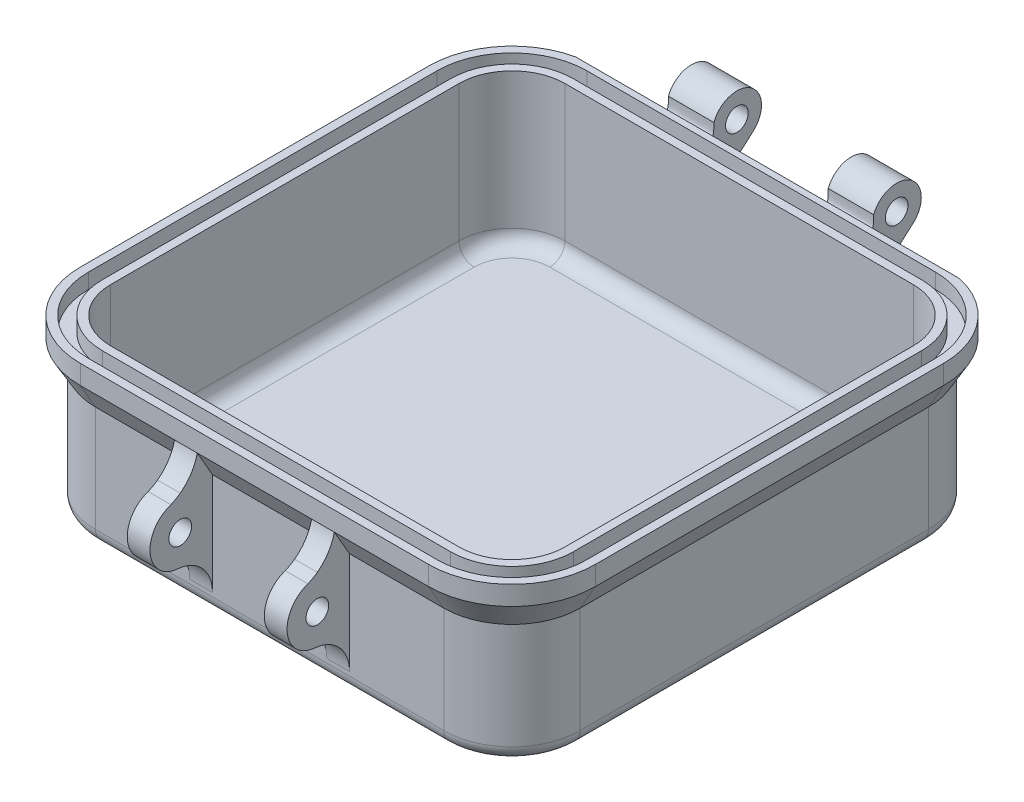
ISO-10303-21;
HEADER;
FILE_DESCRIPTION(('STEP AP214'),'2;1');
FILE_NAME('part.step','',(''),(''),'','','');
FILE_SCHEMA(('AUTOMOTIVE_DESIGN { 1 0 10303 214 1 1 1 1 }'));
ENDSEC;
DATA;
#1=APPLICATION_CONTEXT('core data for automotive mechanical design processes');
#2=APPLICATION_PROTOCOL_DEFINITION('international standard','automotive_design',2000,#1);
#3=PRODUCT_CONTEXT('',#1,'mechanical');
#4=PRODUCT('Part','Part','',(#3));
#5=PRODUCT_RELATED_PRODUCT_CATEGORY('part','',(#4));
#6=PRODUCT_DEFINITION_FORMATION('','',#4);
#7=PRODUCT_DEFINITION_CONTEXT('part definition',#1,'design');
#8=PRODUCT_DEFINITION('design','',#6,#7);
#9=PRODUCT_DEFINITION_SHAPE('','',#8);
#10=(LENGTH_UNIT() NAMED_UNIT(*) SI_UNIT(.MILLI.,.METRE.));
#11=(NAMED_UNIT(*) PLANE_ANGLE_UNIT() SI_UNIT($,.RADIAN.));
#12=(NAMED_UNIT(*) SI_UNIT($,.STERADIAN.) SOLID_ANGLE_UNIT());
#13=UNCERTAINTY_MEASURE_WITH_UNIT(LENGTH_MEASURE(1.E-05),#10,'distance_accuracy_value','');
#14=(GEOMETRIC_REPRESENTATION_CONTEXT(3) GLOBAL_UNCERTAINTY_ASSIGNED_CONTEXT((#13)) GLOBAL_UNIT_ASSIGNED_CONTEXT((#10,
#11,#12)) REPRESENTATION_CONTEXT('',''));
#15=CARTESIAN_POINT('',(0.,0.,0.));
#16=DIRECTION('',(0.,0.,1.));
#17=DIRECTION('',(1.,0.,0.));
#18=AXIS2_PLACEMENT_3D('',#15,#16,#17);
#19=CARTESIAN_POINT('',(23.,19.4641016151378,-34.));
#20=DIRECTION('',(0.,0.500000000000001,0.866025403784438));
#21=DIRECTION('',(-1.,0.,0.));
#22=AXIS2_PLACEMENT_3D('',#19,#20,#21);
#23=PLANE('',#22);
#24=DIRECTION('',(-1.,0.,0.));
#25=VECTOR('',#24,1.);
#26=CARTESIAN_POINT('',(23.,19.4641016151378,-34.));
#27=LINE('',#26,#25);
#28=CARTESIAN_POINT('',(-13.5499999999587,19.4641016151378,-34.));
#29=VERTEX_POINT('',#28);
#30=CARTESIAN_POINT('',(-23.,19.4641016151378,-34.));
#31=VERTEX_POINT('',#30);
#32=EDGE_CURVE('E901',#29,#31,#27,.T.);
#33=ORIENTED_EDGE('',*,*,#32,.F.);
#34=DIRECTION('',(0.,-0.866025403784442,0.499999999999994));
#35=VECTOR('',#34,1.);
#36=CARTESIAN_POINT('',(-13.5499999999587,16.,-32.));
#37=LINE('',#36,#35);
#38=CARTESIAN_POINT('',(-13.5499999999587,16.,-32.));
#39=VERTEX_POINT('',#38);
#40=EDGE_CURVE('E778',#29,#39,#37,.T.);
#41=ORIENTED_EDGE('',*,*,#40,.T.);
#42=DIRECTION('',(-1.,0.,0.));
#43=VECTOR('',#42,1.);
#44=CARTESIAN_POINT('',(-23.,16.,-32.));
#45=LINE('',#44,#43);
#46=CARTESIAN_POINT('',(-23.,16.,-32.));
#47=VERTEX_POINT('',#46);
#48=EDGE_CURVE('E1030',#39,#47,#45,.T.);
#49=ORIENTED_EDGE('',*,*,#48,.T.);
#50=DIRECTION('',(0.,0.866025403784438,-0.500000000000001));
#51=VECTOR('',#50,1.);
#52=CARTESIAN_POINT('',(-23.,16.,-32.));
#53=LINE('',#52,#51);
#54=EDGE_CURVE('E874',#47,#31,#53,.T.);
#55=ORIENTED_EDGE('',*,*,#54,.T.);
#56=EDGE_LOOP('',(#33,#41,#49,#55));
#57=FACE_BOUND('',#56,.T.);
#58=ADVANCED_FACE('F36',(#57),#23,.F.);
#59=CARTESIAN_POINT('',(23.,22.,-34.));
#60=DIRECTION('',(0.,0.,1.));
#61=DIRECTION('',(1.,0.,0.));
#62=AXIS2_PLACEMENT_3D('',#59,#60,#61);
#63=PLANE('',#62);
#64=DIRECTION('',(0.,-1.,0.));
#65=VECTOR('',#64,1.);
#66=CARTESIAN_POINT('',(-23.,22.,-34.));
#67=LINE('',#66,#65);
#68=CARTESIAN_POINT('',(-23.,21.65,-34.));
#69=VERTEX_POINT('',#68);
#70=EDGE_CURVE('E950',#69,#31,#67,.T.);
#71=ORIENTED_EDGE('',*,*,#70,.F.);
#72=DIRECTION('',(-1.,0.,0.));
#73=VECTOR('',#72,1.);
#74=CARTESIAN_POINT('',(34.,21.65,-34.));
#75=LINE('',#74,#73);
#76=CARTESIAN_POINT('',(-13.5499999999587,21.65,-34.));
#77=VERTEX_POINT('',#76);
#78=EDGE_CURVE('E1252',#69,#77,#75,.F.);
#79=ORIENTED_EDGE('',*,*,#78,.T.);
#80=DIRECTION('',(0.,-1.,0.));
#81=VECTOR('',#80,1.);
#82=CARTESIAN_POINT('',(-13.5499999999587,19.4641016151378,-34.));
#83=LINE('',#82,#81);
#84=EDGE_CURVE('E776',#77,#29,#83,.T.);
#85=ORIENTED_EDGE('',*,*,#84,.T.);
#86=ORIENTED_EDGE('',*,*,#32,.T.);
#87=EDGE_LOOP('',(#71,#79,#85,#86));
#88=FACE_BOUND('',#87,.T.);
#89=ADVANCED_FACE('F1166',(#88),#63,.F.);
#90=CARTESIAN_POINT('',(23.,22.,-23.));
#91=DIRECTION('',(0.,1.,0.));
#92=DIRECTION('',(0.,0.,1.));
#93=AXIS2_PLACEMENT_3D('',#90,#91,#92);
#94=PLANE('',#93);
#95=CARTESIAN_POINT('',(23.,22.,-23.));
#96=DIRECTION('',(0.,1.,0.));
#97=DIRECTION('',(0.,0.,1.));
#98=AXIS2_PLACEMENT_3D('',#95,#96,#97);
#99=CIRCLE('',#98,8.1);
#100=CARTESIAN_POINT('',(31.1,22.,-23.));
#101=VERTEX_POINT('',#100);
#102=CARTESIAN_POINT('',(23.,22.,-31.1));
#103=VERTEX_POINT('',#102);
#104=EDGE_CURVE('E536',#101,#103,#99,.T.);
#105=ORIENTED_EDGE('',*,*,#104,.T.);
#106=DIRECTION('',(1.,0.,0.));
#107=VECTOR('',#106,1.);
#108=CARTESIAN_POINT('',(-23.,22.,-31.1));
#109=LINE('',#108,#107);
#110=CARTESIAN_POINT('',(-23.,22.,-31.1));
#111=VERTEX_POINT('',#110);
#112=EDGE_CURVE('E791',#111,#103,#109,.T.);
#113=ORIENTED_EDGE('',*,*,#112,.F.);
#114=CARTESIAN_POINT('',(-23.,22.,-23.));
#115=DIRECTION('',(0.,-1.,0.));
#116=DIRECTION('',(0.,0.,1.));
#117=AXIS2_PLACEMENT_3D('',#114,#115,#116);
#118=CIRCLE('',#117,8.1);
#119=CARTESIAN_POINT('',(-31.1,22.,-23.));
#120=VERTEX_POINT('',#119);
#121=EDGE_CURVE('E839',#120,#111,#118,.T.);
#122=ORIENTED_EDGE('',*,*,#121,.F.);
#123=DIRECTION('',(0.,0.,-1.));
#124=VECTOR('',#123,1.);
#125=CARTESIAN_POINT('',(-31.1,22.,23.));
#126=LINE('',#125,#124);
#127=CARTESIAN_POINT('',(-31.1,22.,23.));
#128=VERTEX_POINT('',#127);
#129=EDGE_CURVE('E836',#128,#120,#126,.T.);
#130=ORIENTED_EDGE('',*,*,#129,.F.);
#131=CARTESIAN_POINT('',(-23.,22.,23.));
#132=DIRECTION('',(0.,-1.,0.));
#133=DIRECTION('',(0.,0.,1.));
#134=AXIS2_PLACEMENT_3D('',#131,#132,#133);
#135=CIRCLE('',#134,8.1);
#136=CARTESIAN_POINT('',(-23.,22.,31.1));
#137=VERTEX_POINT('',#136);
#138=EDGE_CURVE('E833',#137,#128,#135,.T.);
#139=ORIENTED_EDGE('',*,*,#138,.F.);
#140=DIRECTION('',(-1.,0.,0.));
#141=VECTOR('',#140,1.);
#142=CARTESIAN_POINT('',(0.,22.,31.1));
#143=LINE('',#142,#141);
#144=CARTESIAN_POINT('',(23.,22.,31.1));
#145=VERTEX_POINT('',#144);
#146=EDGE_CURVE('E830',#145,#137,#143,.T.);
#147=ORIENTED_EDGE('',*,*,#146,.F.);
#148=CARTESIAN_POINT('',(23.,22.,23.));
#149=DIRECTION('',(0.,1.,0.));
#150=DIRECTION('',(0.,0.,1.));
#151=AXIS2_PLACEMENT_3D('',#148,#149,#150);
#152=CIRCLE('',#151,8.1);
#153=CARTESIAN_POINT('',(31.1,22.,23.));
#154=VERTEX_POINT('',#153);
#155=EDGE_CURVE('E557',#145,#154,#152,.T.);
#156=ORIENTED_EDGE('',*,*,#155,.T.);
#157=DIRECTION('',(0.,0.,-1.));
#158=VECTOR('',#157,1.);
#159=CARTESIAN_POINT('',(31.1,22.,23.));
#160=LINE('',#159,#158);
#161=EDGE_CURVE('E560',#154,#101,#160,.T.);
#162=ORIENTED_EDGE('',*,*,#161,.T.);
#163=EDGE_LOOP('',(#105,#113,#122,#130,#139,#147,#156,#162));
#164=FACE_BOUND('',#163,.T.);
#165=DIRECTION('',(-1.,0.,0.));
#166=VECTOR('',#165,1.);
#167=CARTESIAN_POINT('',(23.,22.,-30.));
#168=LINE('',#167,#166);
#169=CARTESIAN_POINT('',(23.,22.,-30.));
#170=VERTEX_POINT('',#169);
#171=CARTESIAN_POINT('',(-23.,22.,-30.));
#172=VERTEX_POINT('',#171);
#173=EDGE_CURVE('E868',#170,#172,#168,.T.);
#174=ORIENTED_EDGE('',*,*,#173,.F.);
#175=CARTESIAN_POINT('',(23.,22.,-23.));
#176=DIRECTION('',(0.,-1.,0.));
#177=DIRECTION('',(0.,0.,1.));
#178=AXIS2_PLACEMENT_3D('',#175,#176,#177);
#179=CIRCLE('',#178,7.);
#180=CARTESIAN_POINT('',(30.,22.,-23.));
#181=VERTEX_POINT('',#180);
#182=EDGE_CURVE('E594',#170,#181,#179,.T.);
#183=ORIENTED_EDGE('',*,*,#182,.T.);
#184=DIRECTION('',(0.,0.,1.));
#185=VECTOR('',#184,1.);
#186=CARTESIAN_POINT('',(30.,22.,-23.));
#187=LINE('',#186,#185);
#188=CARTESIAN_POINT('',(30.,22.,23.));
#189=VERTEX_POINT('',#188);
#190=EDGE_CURVE('E692',#181,#189,#187,.T.);
#191=ORIENTED_EDGE('',*,*,#190,.T.);
#192=CARTESIAN_POINT('',(23.,22.,23.));
#193=DIRECTION('',(0.,-1.,0.));
#194=DIRECTION('',(0.,0.,1.));
#195=AXIS2_PLACEMENT_3D('',#192,#193,#194);
#196=CIRCLE('',#195,7.);
#197=CARTESIAN_POINT('',(23.,22.,30.));
#198=VERTEX_POINT('',#197);
#199=EDGE_CURVE('E689',#189,#198,#196,.T.);
#200=ORIENTED_EDGE('',*,*,#199,.T.);
#201=DIRECTION('',(1.,0.,0.));
#202=VECTOR('',#201,1.);
#203=CARTESIAN_POINT('',(-23.,22.,30.));
#204=LINE('',#203,#202);
#205=CARTESIAN_POINT('',(-23.,22.,30.));
#206=VERTEX_POINT('',#205);
#207=EDGE_CURVE('E968',#206,#198,#204,.T.);
#208=ORIENTED_EDGE('',*,*,#207,.F.);
#209=CARTESIAN_POINT('',(-23.,22.,23.));
#210=DIRECTION('',(0.,1.,0.));
#211=DIRECTION('',(0.,0.,1.));
#212=AXIS2_PLACEMENT_3D('',#209,#210,#211);
#213=CIRCLE('',#212,7.);
#214=CARTESIAN_POINT('',(-30.,22.,23.));
#215=VERTEX_POINT('',#214);
#216=EDGE_CURVE('E969',#215,#206,#213,.T.);
#217=ORIENTED_EDGE('',*,*,#216,.F.);
#218=DIRECTION('',(0.,0.,1.));
#219=VECTOR('',#218,1.);
#220=CARTESIAN_POINT('',(-30.,22.,-23.));
#221=LINE('',#220,#219);
#222=CARTESIAN_POINT('',(-30.,22.,-23.));
#223=VERTEX_POINT('',#222);
#224=EDGE_CURVE('E972',#223,#215,#221,.T.);
#225=ORIENTED_EDGE('',*,*,#224,.F.);
#226=CARTESIAN_POINT('',(-23.,22.,-23.));
#227=DIRECTION('',(0.,1.,0.));
#228=DIRECTION('',(0.,0.,1.));
#229=AXIS2_PLACEMENT_3D('',#226,#227,#228);
#230=CIRCLE('',#229,7.);
#231=EDGE_CURVE('E975',#172,#223,#230,.T.);
#232=ORIENTED_EDGE('',*,*,#231,.F.);
#233=EDGE_LOOP('',(#174,#183,#191,#200,#208,#217,#225,#232));
#234=FACE_BOUND('',#233,.T.);
#235=ADVANCED_FACE('F1117',(#164,#234),#94,.T.);
#236=CARTESIAN_POINT('',(-34.,22.,-37.25));
#237=DIRECTION('',(1.,0.,0.));
#238=DIRECTION('',(0.,0.,-1.));
#239=AXIS2_PLACEMENT_3D('',#236,#237,#238);
#240=CYLINDRICAL_SURFACE('',#239,1.5);
#241=CARTESIAN_POINT('',(-7.54999999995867,22.,-37.25));
#242=DIRECTION('',(1.,0.,0.));
#243=DIRECTION('',(0.,1.,0.));
#244=AXIS2_PLACEMENT_3D('',#241,#242,#243);
#245=CIRCLE('',#244,1.5);
#246=CARTESIAN_POINT('',(-7.54999999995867,23.5,-37.25));
#247=VERTEX_POINT('',#246);
#248=EDGE_CURVE('E859',#247,#247,#245,.T.);
#249=ORIENTED_EDGE('',*,*,#248,.T.);
#250=EDGE_LOOP('',(#249));
#251=FACE_BOUND('',#250,.T.);
#252=CARTESIAN_POINT('',(-13.5499999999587,22.,-37.25));
#253=DIRECTION('',(1.,0.,0.));
#254=DIRECTION('',(0.,1.,0.));
#255=AXIS2_PLACEMENT_3D('',#252,#253,#254);
#256=CIRCLE('',#255,1.5);
#257=CARTESIAN_POINT('',(-13.5499999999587,23.5,-37.25));
#258=VERTEX_POINT('',#257);
#259=EDGE_CURVE('E765',#258,#258,#256,.T.);
#260=ORIENTED_EDGE('',*,*,#259,.F.);
#261=EDGE_LOOP('',(#260));
#262=FACE_BOUND('',#261,.T.);
#263=ADVANCED_FACE('F1348',(#251,#262),#240,.F.);
#264=CARTESIAN_POINT('',(-32.,16.,23.));
#265=DIRECTION('',(1.,0.,0.));
#266=DIRECTION('',(0.,0.,-1.));
#267=AXIS2_PLACEMENT_3D('',#264,#265,#266);
#268=PLANE('',#267);
#269=DIRECTION('',(0.,-1.,0.));
#270=VECTOR('',#269,1.);
#271=CARTESIAN_POINT('',(-32.,16.,-23.));
#272=LINE('',#271,#270);
#273=CARTESIAN_POINT('',(-32.,16.,-23.));
#274=VERTEX_POINT('',#273);
#275=CARTESIAN_POINT('',(-32.,2.,-23.));
#276=VERTEX_POINT('',#275);
#277=EDGE_CURVE('E917',#274,#276,#272,.T.);
#278=ORIENTED_EDGE('',*,*,#277,.T.);
#279=DIRECTION('',(0.,0.,1.));
#280=VECTOR('',#279,1.);
#281=CARTESIAN_POINT('',(-32.,2.,23.));
#282=LINE('',#281,#280);
#283=CARTESIAN_POINT('',(-32.,2.,23.));
#284=VERTEX_POINT('',#283);
#285=EDGE_CURVE('E913',#276,#284,#282,.T.);
#286=ORIENTED_EDGE('',*,*,#285,.T.);
#287=DIRECTION('',(0.,-1.,0.));
#288=VECTOR('',#287,1.);
#289=CARTESIAN_POINT('',(-32.,16.,23.));
#290=LINE('',#289,#288);
#291=CARTESIAN_POINT('',(-32.,16.,23.));
#292=VERTEX_POINT('',#291);
#293=EDGE_CURVE('E920',#292,#284,#290,.T.);
#294=ORIENTED_EDGE('',*,*,#293,.F.);
#295=DIRECTION('',(0.,0.,1.));
#296=VECTOR('',#295,1.);
#297=CARTESIAN_POINT('',(-32.,16.,23.));
#298=LINE('',#297,#296);
#299=EDGE_CURVE('E933',#274,#292,#298,.T.);
#300=ORIENTED_EDGE('',*,*,#299,.F.);
#301=EDGE_LOOP('',(#278,#286,#294,#300));
#302=FACE_BOUND('',#301,.T.);
#303=ADVANCED_FACE('F1350',(#302),#268,.F.);
#304=CARTESIAN_POINT('',(-34.,19.4641016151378,-23.));
#305=DIRECTION('',(0.866025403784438,0.500000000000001,0.));
#306=DIRECTION('',(0.,0.,1.));
#307=AXIS2_PLACEMENT_3D('',#304,#305,#306);
#308=PLANE('',#307);
#309=DIRECTION('',(-0.500000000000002,0.866025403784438,0.));
#310=VECTOR('',#309,1.);
#311=CARTESIAN_POINT('',(-32.,16.,23.));
#312=LINE('',#311,#310);
#313=CARTESIAN_POINT('',(-34.,19.4641016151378,23.));
#314=VERTEX_POINT('',#313);
#315=EDGE_CURVE('E867',#292,#314,#312,.T.);
#316=ORIENTED_EDGE('',*,*,#315,.T.);
#317=DIRECTION('',(0.,0.,1.));
#318=VECTOR('',#317,1.);
#319=CARTESIAN_POINT('',(-34.,19.4641016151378,-23.));
#320=LINE('',#319,#318);
#321=CARTESIAN_POINT('',(-34.,19.4641016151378,-23.));
#322=VERTEX_POINT('',#321);
#323=EDGE_CURVE('E880',#322,#314,#320,.T.);
#324=ORIENTED_EDGE('',*,*,#323,.F.);
#325=DIRECTION('',(-0.500000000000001,0.866025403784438,0.));
#326=VECTOR('',#325,1.);
#327=CARTESIAN_POINT('',(-32.,16.,-23.));
#328=LINE('',#327,#326);
#329=EDGE_CURVE('E871',#274,#322,#328,.T.);
#330=ORIENTED_EDGE('',*,*,#329,.F.);
#331=ORIENTED_EDGE('',*,*,#299,.T.);
#332=EDGE_LOOP('',(#316,#324,#330,#331));
#333=FACE_BOUND('',#332,.T.);
#334=ADVANCED_FACE('F1463',(#333),#308,.F.);
#335=CARTESIAN_POINT('',(-23.,19.4641016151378,-23.));
#336=DIRECTION('',(0.,1.,0.));
#337=DIRECTION('',(0.,0.,1.));
#338=AXIS2_PLACEMENT_3D('',#335,#336,#337);
#339=CONICAL_SURFACE('',#338,11.,0.5235987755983);
#340=ORIENTED_EDGE('',*,*,#329,.T.);
#341=CARTESIAN_POINT('',(-23.,19.4641016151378,-23.));
#342=DIRECTION('',(0.,1.,0.));
#343=DIRECTION('',(0.,0.,1.));
#344=AXIS2_PLACEMENT_3D('',#341,#342,#343);
#345=CIRCLE('',#344,11.);
#346=EDGE_CURVE('E882',#31,#322,#345,.T.);
#347=ORIENTED_EDGE('',*,*,#346,.F.);
#348=ORIENTED_EDGE('',*,*,#54,.F.);
#349=CARTESIAN_POINT('',(-23.,16.,-23.));
#350=DIRECTION('',(0.,1.,0.));
#351=DIRECTION('',(0.,0.,1.));
#352=AXIS2_PLACEMENT_3D('',#349,#350,#351);
#353=CIRCLE('',#352,9.);
#354=EDGE_CURVE('E890',#47,#274,#353,.T.);
#355=ORIENTED_EDGE('',*,*,#354,.T.);
#356=EDGE_LOOP('',(#340,#347,#348,#355));
#357=FACE_BOUND('',#356,.T.);
#358=ADVANCED_FACE('F1299',(#357),#339,.T.);
#359=CARTESIAN_POINT('',(-23.,19.4641016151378,23.));
#360=DIRECTION('',(0.,1.,0.));
#361=DIRECTION('',(0.,0.,1.));
#362=AXIS2_PLACEMENT_3D('',#359,#360,#361);
#363=CONICAL_SURFACE('',#362,11.,0.5235987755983);
#364=ORIENTED_EDGE('',*,*,#315,.F.);
#365=CARTESIAN_POINT('',(-23.,16.,23.));
#366=DIRECTION('',(0.,1.,0.));
#367=DIRECTION('',(0.,0.,1.));
#368=AXIS2_PLACEMENT_3D('',#365,#366,#367);
#369=CIRCLE('',#368,9.);
#370=CARTESIAN_POINT('',(-23.,16.,32.));
#371=VERTEX_POINT('',#370);
#372=EDGE_CURVE('E930',#292,#371,#369,.T.);
#373=ORIENTED_EDGE('',*,*,#372,.T.);
#374=DIRECTION('',(0.,-0.866025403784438,-0.500000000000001));
#375=VECTOR('',#374,1.);
#376=CARTESIAN_POINT('',(-23.,19.4641016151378,34.));
#377=LINE('',#376,#375);
#378=CARTESIAN_POINT('',(-23.,19.4641016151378,34.));
#379=VERTEX_POINT('',#378);
#380=EDGE_CURVE('E864',#379,#371,#377,.T.);
#381=ORIENTED_EDGE('',*,*,#380,.F.);
#382=CARTESIAN_POINT('',(-23.,19.4641016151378,23.));
#383=DIRECTION('',(0.,1.,0.));
#384=DIRECTION('',(0.,0.,1.));
#385=AXIS2_PLACEMENT_3D('',#382,#383,#384);
#386=CIRCLE('',#385,11.);
#387=EDGE_CURVE('E845',#314,#379,#386,.T.);
#388=ORIENTED_EDGE('',*,*,#387,.F.);
#389=EDGE_LOOP('',(#364,#373,#381,#388));
#390=FACE_BOUND('',#389,.T.);
#391=ADVANCED_FACE('F1410',(#390),#363,.T.);
#392=CARTESIAN_POINT('',(-34.,11.5,36.25));
#393=DIRECTION('',(1.,0.,0.));
#394=DIRECTION('',(0.,0.,-1.));
#395=AXIS2_PLACEMENT_3D('',#392,#393,#394);
#396=CYLINDRICAL_SURFACE('',#395,1.5);
#397=CARTESIAN_POINT('',(-10.55,11.5,36.25));
#398=DIRECTION('',(-1.,0.,0.));
#399=DIRECTION('',(0.,-1.,0.));
#400=AXIS2_PLACEMENT_3D('',#397,#398,#399);
#401=CIRCLE('',#400,1.5);
#402=CARTESIAN_POINT('',(-10.55,10.,36.25));
#403=VERTEX_POINT('',#402);
#404=EDGE_CURVE('E998',#403,#403,#401,.T.);
#405=ORIENTED_EDGE('',*,*,#404,.T.);
#406=EDGE_LOOP('',(#405));
#407=FACE_BOUND('',#406,.T.);
#408=CARTESIAN_POINT('',(-7.54999999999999,11.5,36.25));
#409=DIRECTION('',(1.,0.,0.));
#410=DIRECTION('',(0.,1.,0.));
#411=AXIS2_PLACEMENT_3D('',#408,#409,#410);
#412=CIRCLE('',#411,1.5);
#413=CARTESIAN_POINT('',(-7.54999999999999,13.,36.25));
#414=VERTEX_POINT('',#413);
#415=EDGE_CURVE('E863',#414,#414,#412,.T.);
#416=ORIENTED_EDGE('',*,*,#415,.T.);
#417=EDGE_LOOP('',(#416));
#418=FACE_BOUND('',#417,.T.);
#419=ADVANCED_FACE('F1366',(#407,#418),#396,.F.);
#420=CARTESIAN_POINT('',(34.,21.2829642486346,40.0368573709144));
#421=DIRECTION('',(-1.,0.,0.));
#422=DIRECTION('',(0.,0.,1.));
#423=AXIS2_PLACEMENT_3D('',#420,#421,#422);
#424=CYLINDRICAL_SURFACE('',#423,6.5);
#425=CARTESIAN_POINT('',(-7.54999999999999,21.2829642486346,40.0368573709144));
#426=DIRECTION('',(1.,0.,0.));
#427=DIRECTION('',(0.,1.,0.));
#428=AXIS2_PLACEMENT_3D('',#425,#426,#427);
#429=CIRCLE('',#428,6.5);
#430=CARTESIAN_POINT('',(-7.54999999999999,15.3037333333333,37.4875834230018));
#431=VERTEX_POINT('',#430);
#432=CARTESIAN_POINT('',(-7.54999999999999,16.,36.25));
#433=VERTEX_POINT('',#432);
#434=EDGE_CURVE('E1004',#431,#433,#429,.T.);
#435=ORIENTED_EDGE('',*,*,#434,.T.);
#436=DIRECTION('',(-1.,0.,0.));
#437=VECTOR('',#436,1.);
#438=CARTESIAN_POINT('',(34.,16.,36.25));
#439=LINE('',#438,#437);
#440=CARTESIAN_POINT('',(-10.55,16.,36.25));
#441=VERTEX_POINT('',#440);
#442=EDGE_CURVE('E1038',#433,#441,#439,.T.);
#443=ORIENTED_EDGE('',*,*,#442,.T.);
#444=CARTESIAN_POINT('',(-10.55,21.2829642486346,40.0368573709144));
#445=DIRECTION('',(-1.,0.,0.));
#446=DIRECTION('',(0.,0.,1.));
#447=AXIS2_PLACEMENT_3D('',#444,#445,#446);
#448=CIRCLE('',#447,6.5);
#449=CARTESIAN_POINT('',(-10.55,15.3037333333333,37.4875834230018));
#450=VERTEX_POINT('',#449);
#451=EDGE_CURVE('E1013',#441,#450,#448,.T.);
#452=ORIENTED_EDGE('',*,*,#451,.T.);
#453=DIRECTION('',(-1.,0.,0.));
#454=VECTOR('',#453,1.);
#455=CARTESIAN_POINT('',(34.,15.3037333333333,37.4875834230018));
#456=LINE('',#455,#454);
#457=EDGE_CURVE('E1009',#431,#450,#456,.T.);
#458=ORIENTED_EDGE('',*,*,#457,.F.);
#459=EDGE_LOOP('',(#435,#443,#452,#458));
#460=FACE_BOUND('',#459,.T.);
#461=ADVANCED_FACE('F1368',(#460),#424,.F.);
#462=CARTESIAN_POINT('',(34.,11.5,36.25));
#463=DIRECTION('',(-1.,0.,0.));
#464=DIRECTION('',(0.,0.,1.));
#465=AXIS2_PLACEMENT_3D('',#462,#463,#464);
#466=CYLINDRICAL_SURFACE('',#465,4.);
#467=CARTESIAN_POINT('',(-10.55,11.5,36.25));
#468=DIRECTION('',(1.,0.,0.));
#469=DIRECTION('',(0.,0.,1.));
#470=AXIS2_PLACEMENT_3D('',#467,#468,#469);
#471=CIRCLE('',#470,4.);
#472=CARTESIAN_POINT('',(-10.55,7.51391308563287,36.5833333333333));
#473=VERTEX_POINT('',#472);
#474=EDGE_CURVE('E1010',#450,#473,#471,.T.);
#475=ORIENTED_EDGE('',*,*,#474,.T.);
#476=DIRECTION('',(-1.,0.,0.));
#477=VECTOR('',#476,1.);
#478=CARTESIAN_POINT('',(34.,7.51391308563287,36.5833333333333));
#479=LINE('',#478,#477);
#480=CARTESIAN_POINT('',(-7.54999999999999,7.51391308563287,36.5833333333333));
#481=VERTEX_POINT('',#480);
#482=EDGE_CURVE('E1020',#473,#481,#479,.F.);
#483=ORIENTED_EDGE('',*,*,#482,.T.);
#484=CARTESIAN_POINT('',(-7.54999999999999,11.5,36.25));
#485=DIRECTION('',(1.,0.,0.));
#486=DIRECTION('',(0.,1.,0.));
#487=AXIS2_PLACEMENT_3D('',#484,#485,#486);
#488=CIRCLE('',#487,4.);
#489=EDGE_CURVE('E862',#481,#431,#488,.F.);
#490=ORIENTED_EDGE('',*,*,#489,.T.);
#491=ORIENTED_EDGE('',*,*,#457,.T.);
#492=EDGE_LOOP('',(#475,#483,#490,#491));
#493=FACE_BOUND('',#492,.T.);
#494=ADVANCED_FACE('F1371',(#493),#466,.T.);
#495=CARTESIAN_POINT('',(-23.,16.,23.));
#496=DIRECTION('',(0.,-1.,0.));
#497=DIRECTION('',(0.,0.,-1.));
#498=AXIS2_PLACEMENT_3D('',#495,#496,#497);
#499=CYLINDRICAL_SURFACE('',#498,9.);
#500=ORIENTED_EDGE('',*,*,#293,.T.);
#501=CARTESIAN_POINT('',(-23.,2.,23.));
#502=DIRECTION('',(0.,1.,0.));
#503=DIRECTION('',(0.,0.,1.));
#504=AXIS2_PLACEMENT_3D('',#501,#502,#503);
#505=CIRCLE('',#504,9.);
#506=CARTESIAN_POINT('',(-23.,2.,32.));
#507=VERTEX_POINT('',#506);
#508=EDGE_CURVE('E902',#284,#507,#505,.T.);
#509=ORIENTED_EDGE('',*,*,#508,.T.);
#510=DIRECTION('',(0.,-1.,0.));
#511=VECTOR('',#510,1.);
#512=CARTESIAN_POINT('',(-23.,16.,32.));
#513=LINE('',#512,#511);
#514=EDGE_CURVE('E923',#371,#507,#513,.T.);
#515=ORIENTED_EDGE('',*,*,#514,.F.);
#516=ORIENTED_EDGE('',*,*,#372,.F.);
#517=EDGE_LOOP('',(#500,#509,#515,#516));
#518=FACE_BOUND('',#517,.T.);
#519=ADVANCED_FACE('F1189',(#518),#499,.T.);
#520=CARTESIAN_POINT('',(-10.55,22.,-34.002));
#521=DIRECTION('',(-1.,0.,0.));
#522=DIRECTION('',(0.,-1.,0.));
#523=AXIS2_PLACEMENT_3D('',#520,#521,#522);
#524=PLANE('',#523);
#525=ORIENTED_EDGE('',*,*,#474,.F.);
#526=ORIENTED_EDGE('',*,*,#451,.F.);
#527=CARTESIAN_POINT('',(-10.55,20.8005510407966,39.8492651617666));
#528=DIRECTION('',(-1.,0.,0.));
#529=DIRECTION('',(0.,0.,1.));
#530=AXIS2_PLACEMENT_3D('',#527,#528,#529);
#531=CIRCLE('',#530,6.);
#532=CARTESIAN_POINT('',(-10.55,19.4641016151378,34.));
#533=VERTEX_POINT('',#532);
#534=EDGE_CURVE('E1017',#533,#441,#531,.T.);
#535=ORIENTED_EDGE('',*,*,#534,.F.);
#536=DIRECTION('',(0.,-0.866025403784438,-0.500000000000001));
#537=VECTOR('',#536,1.);
#538=CARTESIAN_POINT('',(-10.55,-8.07970435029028,18.0975762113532));
#539=LINE('',#538,#537);
#540=CARTESIAN_POINT('',(-10.55,16.,32.));
#541=VERTEX_POINT('',#540);
#542=EDGE_CURVE('E981',#541,#533,#539,.F.);
#543=ORIENTED_EDGE('',*,*,#542,.F.);
#544=DIRECTION('',(0.,-1.,0.));
#545=VECTOR('',#544,1.);
#546=CARTESIAN_POINT('',(-10.55,22.,32.));
#547=LINE('',#546,#545);
#548=CARTESIAN_POINT('',(-10.55,2.53130444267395,32.));
#549=VERTEX_POINT('',#548);
#550=EDGE_CURVE('E984',#541,#549,#547,.T.);
#551=ORIENTED_EDGE('',*,*,#550,.T.);
#552=CARTESIAN_POINT('',(-10.55,2.53130444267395,37.));
#553=DIRECTION('',(-1.,0.,0.));
#554=DIRECTION('',(0.,-1.,0.));
#555=AXIS2_PLACEMENT_3D('',#552,#553,#554);
#556=CIRCLE('',#555,5.);
#557=EDGE_CURVE('E503',#549,#473,#556,.F.);
#558=ORIENTED_EDGE('',*,*,#557,.T.);
#559=EDGE_LOOP('',(#525,#526,#535,#543,#551,#558));
#560=FACE_BOUND('',#559,.T.);
#561=ORIENTED_EDGE('',*,*,#404,.F.);
#562=EDGE_LOOP('',(#561));
#563=FACE_BOUND('',#562,.T.);
#564=ADVANCED_FACE('F1180',(#560,#563),#524,.T.);
#565=CARTESIAN_POINT('',(7.54999999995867,19.4641016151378,-34.));
#566=VERTEX_POINT('',#565);
#567=CARTESIAN_POINT('',(-7.54999999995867,19.4641016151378,-34.));
#568=VERTEX_POINT('',#567);
#569=EDGE_CURVE('E885',#566,#568,#27,.T.);
#570=ORIENTED_EDGE('',*,*,#569,.F.);
#571=DIRECTION('',(0.,-0.866025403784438,0.500000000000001));
#572=VECTOR('',#571,1.);
#573=CARTESIAN_POINT('',(7.5499999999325,-218691.751559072,126238.979236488));
#574=LINE('',#573,#572);
#575=CARTESIAN_POINT('',(7.54999999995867,16.0000000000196,-31.9999999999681));
#576=VERTEX_POINT('',#575);
#577=EDGE_CURVE('E709',#576,#566,#574,.F.);
#578=ORIENTED_EDGE('',*,*,#577,.F.);
#579=CARTESIAN_POINT('',(-7.54999999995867,16.0000000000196,-31.9999999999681));
#580=VERTEX_POINT('',#579);
#581=EDGE_CURVE('E929',#576,#580,#45,.T.);
#582=ORIENTED_EDGE('',*,*,#581,.T.);
#583=DIRECTION('',(0.,-0.866025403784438,0.500000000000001));
#584=VECTOR('',#583,1.);
#585=CARTESIAN_POINT('',(-7.5499999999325,-218691.751559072,126238.979236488));
#586=LINE('',#585,#584);
#587=EDGE_CURVE('E988',#580,#568,#586,.F.);
#588=ORIENTED_EDGE('',*,*,#587,.T.);
#589=EDGE_LOOP('',(#570,#578,#582,#588));
#590=FACE_BOUND('',#589,.T.);
#591=ADVANCED_FACE('F1169',(#590),#23,.F.);
#592=CARTESIAN_POINT('',(-7.54999999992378,-291552.47636288,40.502));
#593=DIRECTION('',(1.,0.,0.));
#594=DIRECTION('',(0.,1.,0.));
#595=AXIS2_PLACEMENT_3D('',#592,#593,#594);
#596=PLANE('',#595);
#597=CARTESIAN_POINT('',(-7.55000000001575,25.6228879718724,-33.5350686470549));
#598=DIRECTION('',(-1.,0.,0.));
#599=DIRECTION('',(0.,-0.993221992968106,-0.116232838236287));
#600=AXIS2_PLACEMENT_3D('',#597,#598,#599);
#601=ELLIPSE('',#600,4.,0.500000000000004);
#602=CARTESIAN_POINT('',(-7.54999999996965,21.65,-34.));
#603=VERTEX_POINT('',#602);
#604=CARTESIAN_POINT('',(-7.54999999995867,23.1591278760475,-34.2137321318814));
#605=VERTEX_POINT('',#604);
#606=EDGE_CURVE('E1213',#603,#605,#601,.F.);
#607=ORIENTED_EDGE('',*,*,#606,.F.);
#608=DIRECTION('',(0.,-1.,0.));
#609=VECTOR('',#608,1.);
#610=CARTESIAN_POINT('',(-7.54999999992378,-291552.47636288,-34.));
#611=LINE('',#610,#609);
#612=EDGE_CURVE('E980',#603,#568,#611,.T.);
#613=ORIENTED_EDGE('',*,*,#612,.T.);
#614=ORIENTED_EDGE('',*,*,#587,.F.);
#615=DIRECTION('',(0.,-1.,0.));
#616=VECTOR('',#615,1.);
#617=CARTESIAN_POINT('',(-7.54999999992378,-291552.47636288,-32.));
#618=LINE('',#617,#616);
#619=CARTESIAN_POINT('',(-7.54999999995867,13.0427712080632,-32.));
#620=VERTEX_POINT('',#619);
#621=EDGE_CURVE('E992',#580,#620,#618,.T.);
#622=ORIENTED_EDGE('',*,*,#621,.T.);
#623=DIRECTION('',(0.,-0.661085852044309,0.750310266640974));
#624=VECTOR('',#623,1.);
#625=CARTESIAN_POINT('',(-7.54999999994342,-127447.111606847,144630.999702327));
#626=LINE('',#625,#624);
#627=CARTESIAN_POINT('',(-7.54999999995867,19.5614916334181,-39.3985290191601));
#628=VERTEX_POINT('',#627);
#629=EDGE_CURVE('E762',#628,#620,#626,.T.);
#630=ORIENTED_EDGE('',*,*,#629,.F.);
#631=CARTESIAN_POINT('',(-7.54999999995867,22.,-37.25));
#632=DIRECTION('',(1.,0.,0.));
#633=DIRECTION('',(0.,1.,0.));
#634=AXIS2_PLACEMENT_3D('',#631,#632,#633);
#635=CIRCLE('',#634,3.25);
#636=EDGE_CURVE('E991',#628,#605,#635,.T.);
#637=ORIENTED_EDGE('',*,*,#636,.T.);
#638=EDGE_LOOP('',(#607,#613,#614,#622,#630,#637));
#639=FACE_BOUND('',#638,.T.);
#640=ORIENTED_EDGE('',*,*,#248,.F.);
#641=EDGE_LOOP('',(#640));
#642=FACE_BOUND('',#641,.T.);
#643=ADVANCED_FACE('F1179',(#639,#642),#596,.T.);
#644=CARTESIAN_POINT('',(-23.,16.,-23.));
#645=DIRECTION('',(0.,-1.,0.));
#646=DIRECTION('',(0.,0.,-1.));
#647=AXIS2_PLACEMENT_3D('',#644,#645,#646);
#648=CYLINDRICAL_SURFACE('',#647,9.);
#649=DIRECTION('',(0.,-1.,0.));
#650=VECTOR('',#649,1.);
#651=CARTESIAN_POINT('',(-23.,16.,-32.));
#652=LINE('',#651,#650);
#653=CARTESIAN_POINT('',(-23.,2.,-32.));
#654=VERTEX_POINT('',#653);
#655=EDGE_CURVE('E926',#47,#654,#652,.T.);
#656=ORIENTED_EDGE('',*,*,#655,.T.);
#657=CARTESIAN_POINT('',(-23.,2.,-23.));
#658=DIRECTION('',(0.,1.,0.));
#659=DIRECTION('',(0.,0.,1.));
#660=AXIS2_PLACEMENT_3D('',#657,#658,#659);
#661=CIRCLE('',#660,9.);
#662=EDGE_CURVE('E898',#654,#276,#661,.T.);
#663=ORIENTED_EDGE('',*,*,#662,.T.);
#664=ORIENTED_EDGE('',*,*,#277,.F.);
#665=ORIENTED_EDGE('',*,*,#354,.F.);
#666=EDGE_LOOP('',(#656,#663,#664,#665));
#667=FACE_BOUND('',#666,.T.);
#668=ADVANCED_FACE('F1186',(#667),#648,.T.);
#669=CARTESIAN_POINT('',(-30.,2.,23.));
#670=DIRECTION('',(0.,0.,1.));
#671=DIRECTION('',(1.,0.,0.));
#672=AXIS2_PLACEMENT_3D('',#669,#670,#671);
#673=CYLINDRICAL_SURFACE('',#672,2.);
#674=CARTESIAN_POINT('',(-30.,2.,-23.));
#675=DIRECTION('',(0.,0.,1.));
#676=DIRECTION('',(1.,0.,0.));
#677=AXIS2_PLACEMENT_3D('',#674,#675,#676);
#678=CIRCLE('',#677,2.);
#679=CARTESIAN_POINT('',(-30.,0.,-23.));
#680=VERTEX_POINT('',#679);
#681=EDGE_CURVE('E893',#276,#680,#678,.T.);
#682=ORIENTED_EDGE('',*,*,#681,.T.);
#683=DIRECTION('',(0.,0.,1.));
#684=VECTOR('',#683,1.);
#685=CARTESIAN_POINT('',(-30.,0.,-23.));
#686=LINE('',#685,#684);
#687=CARTESIAN_POINT('',(-30.,0.,23.));
#688=VERTEX_POINT('',#687);
#689=EDGE_CURVE('E904',#688,#680,#686,.F.);
#690=ORIENTED_EDGE('',*,*,#689,.F.);
#691=CARTESIAN_POINT('',(-30.,2.,23.));
#692=DIRECTION('',(0.,0.,-1.));
#693=DIRECTION('',(-1.,0.,0.));
#694=AXIS2_PLACEMENT_3D('',#691,#692,#693);
#695=CIRCLE('',#694,2.);
#696=EDGE_CURVE('E895',#688,#284,#695,.T.);
#697=ORIENTED_EDGE('',*,*,#696,.T.);
#698=ORIENTED_EDGE('',*,*,#285,.F.);
#699=EDGE_LOOP('',(#682,#690,#697,#698));
#700=FACE_BOUND('',#699,.T.);
#701=ADVANCED_FACE('F1468',(#700),#673,.T.);
#702=CARTESIAN_POINT('',(-23.,2.,-23.));
#703=DIRECTION('',(0.,1.,0.));
#704=DIRECTION('',(0.,0.,1.));
#705=AXIS2_PLACEMENT_3D('',#702,#703,#704);
#706=TOROIDAL_SURFACE('',#705,7.,2.);
#707=CARTESIAN_POINT('',(-23.,2.,-30.));
#708=DIRECTION('',(-1.,0.,0.));
#709=DIRECTION('',(0.,0.,1.));
#710=AXIS2_PLACEMENT_3D('',#707,#708,#709);
#711=CIRCLE('',#710,2.);
#712=CARTESIAN_POINT('',(-23.,0.,-30.));
#713=VERTEX_POINT('',#712);
#714=EDGE_CURVE('E886',#654,#713,#711,.T.);
#715=ORIENTED_EDGE('',*,*,#714,.T.);
#716=CARTESIAN_POINT('',(-23.,0.,-23.));
#717=DIRECTION('',(0.,1.,0.));
#718=DIRECTION('',(0.,0.,1.));
#719=AXIS2_PLACEMENT_3D('',#716,#717,#718);
#720=CIRCLE('',#719,7.);
#721=EDGE_CURVE('E911',#680,#713,#720,.F.);
#722=ORIENTED_EDGE('',*,*,#721,.F.);
#723=ORIENTED_EDGE('',*,*,#681,.F.);
#724=ORIENTED_EDGE('',*,*,#662,.F.);
#725=EDGE_LOOP('',(#715,#722,#723,#724));
#726=FACE_BOUND('',#725,.T.);
#727=ADVANCED_FACE('F1604',(#726),#706,.T.);
#728=CARTESIAN_POINT('',(-23.,2.,23.));
#729=DIRECTION('',(0.,1.,0.));
#730=DIRECTION('',(0.,0.,1.));
#731=AXIS2_PLACEMENT_3D('',#728,#729,#730);
#732=TOROIDAL_SURFACE('',#731,7.,2.);
#733=CARTESIAN_POINT('',(-23.,2.,30.));
#734=DIRECTION('',(-1.,0.,0.));
#735=DIRECTION('',(0.,0.,1.));
#736=AXIS2_PLACEMENT_3D('',#733,#734,#735);
#737=CIRCLE('',#736,2.);
#738=CARTESIAN_POINT('',(-23.,0.,30.));
#739=VERTEX_POINT('',#738);
#740=EDGE_CURVE('E889',#739,#507,#737,.T.);
#741=ORIENTED_EDGE('',*,*,#740,.T.);
#742=ORIENTED_EDGE('',*,*,#508,.F.);
#743=ORIENTED_EDGE('',*,*,#696,.F.);
#744=CARTESIAN_POINT('',(-23.,0.,23.));
#745=DIRECTION('',(0.,1.,0.));
#746=DIRECTION('',(0.,0.,1.));
#747=AXIS2_PLACEMENT_3D('',#744,#745,#746);
#748=CIRCLE('',#747,7.);
#749=EDGE_CURVE('E908',#739,#688,#748,.F.);
#750=ORIENTED_EDGE('',*,*,#749,.F.);
#751=EDGE_LOOP('',(#741,#742,#743,#750));
#752=FACE_BOUND('',#751,.T.);
#753=ADVANCED_FACE('F1333',(#752),#732,.T.);
#754=CARTESIAN_POINT('',(-34.,22.,-23.));
#755=DIRECTION('',(1.,0.,0.));
#756=DIRECTION('',(0.,0.,-1.));
#757=AXIS2_PLACEMENT_3D('',#754,#755,#756);
#758=PLANE('',#757);
#759=DIRECTION('',(0.,-1.,0.));
#760=VECTOR('',#759,1.);
#761=CARTESIAN_POINT('',(-34.,22.,-23.));
#762=LINE('',#761,#760);
#763=CARTESIAN_POINT('',(-34.,22.,-23.));
#764=VERTEX_POINT('',#763);
#765=EDGE_CURVE('E952',#764,#322,#762,.T.);
#766=ORIENTED_EDGE('',*,*,#765,.T.);
#767=ORIENTED_EDGE('',*,*,#323,.T.);
#768=DIRECTION('',(0.,-1.,0.));
#769=VECTOR('',#768,1.);
#770=CARTESIAN_POINT('',(-34.,22.,23.));
#771=LINE('',#770,#769);
#772=CARTESIAN_POINT('',(-34.,22.,23.));
#773=VERTEX_POINT('',#772);
#774=EDGE_CURVE('E955',#773,#314,#771,.T.);
#775=ORIENTED_EDGE('',*,*,#774,.F.);
#776=DIRECTION('',(0.,0.,1.));
#777=VECTOR('',#776,1.);
#778=CARTESIAN_POINT('',(-34.,22.,-23.));
#779=LINE('',#778,#777);
#780=EDGE_CURVE('E964',#764,#773,#779,.T.);
#781=ORIENTED_EDGE('',*,*,#780,.F.);
#782=EDGE_LOOP('',(#766,#767,#775,#781));
#783=FACE_BOUND('',#782,.T.);
#784=ADVANCED_FACE('F1328',(#783),#758,.F.);
#785=CARTESIAN_POINT('',(-23.,22.,-23.));
#786=DIRECTION('',(0.,-1.,0.));
#787=DIRECTION('',(0.,0.,-1.));
#788=AXIS2_PLACEMENT_3D('',#785,#786,#787);
#789=CYLINDRICAL_SURFACE('',#788,11.);
#790=CARTESIAN_POINT('',(-23.,22.,-23.));
#791=DIRECTION('',(0.,1.,0.));
#792=DIRECTION('',(0.,0.,1.));
#793=AXIS2_PLACEMENT_3D('',#790,#791,#792);
#794=CIRCLE('',#793,11.);
#795=CARTESIAN_POINT('',(-25.3518700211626,22.,-33.7456366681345));
#796=VERTEX_POINT('',#795);
#797=EDGE_CURVE('E966',#796,#764,#794,.T.);
#798=ORIENTED_EDGE('',*,*,#797,.F.);
#799=CARTESIAN_POINT('',(-25.3518700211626,22.,-33.7456366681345));
#800=CARTESIAN_POINT('',(-25.2997206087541,21.971182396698,-33.7570532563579));
#801=CARTESIAN_POINT('',(-25.2464843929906,21.9442710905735,-33.7683044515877));
#802=CARTESIAN_POINT('',(-25.1381574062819,21.8943542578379,-33.7903345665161));
#803=CARTESIAN_POINT('',(-25.0830677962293,21.8713463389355,-33.8011137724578));
#804=CARTESIAN_POINT('',(-24.9720478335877,21.8295795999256,-33.8219303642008));
#805=CARTESIAN_POINT('',(-24.9161390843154,21.8107672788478,-33.8319758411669));
#806=CARTESIAN_POINT('',(-24.8030792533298,21.7768888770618,-33.8513683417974));
#807=CARTESIAN_POINT('',(-24.7459280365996,21.7618232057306,-33.8607152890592));
#808=CARTESIAN_POINT('',(-24.6210005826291,21.7329572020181,-33.8801192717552));
#809=CARTESIAN_POINT('',(-24.5530546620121,21.7197963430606,-33.8900311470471));
#810=CARTESIAN_POINT('',(-24.4163193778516,21.6976511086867,-33.9086572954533));
#811=CARTESIAN_POINT('',(-24.3475297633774,21.6886680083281,-33.9173712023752));
#812=CARTESIAN_POINT('',(-24.2089939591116,21.6740651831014,-33.933582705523));
#813=CARTESIAN_POINT('',(-24.1392444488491,21.6684683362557,-33.9410717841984));
#814=CARTESIAN_POINT('',(-23.9994677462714,21.659875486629,-33.9547248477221));
#815=CARTESIAN_POINT('',(-23.9294405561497,21.6568794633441,-33.9608888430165));
#816=CARTESIAN_POINT('',(-23.7874917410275,21.6525879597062,-33.9720121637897));
#817=CARTESIAN_POINT('',(-23.7155663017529,21.651336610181,-33.97693772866));
#818=CARTESIAN_POINT('',(-23.5716245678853,21.6498562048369,-33.9853740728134));
#819=CARTESIAN_POINT('',(-23.4996082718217,21.6496271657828,-33.9888848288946));
#820=CARTESIAN_POINT('',(-23.356334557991,21.649538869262,-33.9944580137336));
#821=CARTESIAN_POINT('',(-23.2850777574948,21.6496754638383,-33.9965363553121));
#822=CARTESIAN_POINT('',(-23.1781780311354,21.6498501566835,-33.9986145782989));
#823=CARTESIAN_POINT('',(-23.142544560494,21.6499033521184,-33.9991341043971));
#824=CARTESIAN_POINT('',(-23.0712741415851,21.6499794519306,-33.99982681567));
#825=CARTESIAN_POINT('',(-23.0356371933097,21.6500023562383,-34.0000000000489));
#826=CARTESIAN_POINT('',(-23.,21.65,-34.));
#827=B_SPLINE_CURVE_WITH_KNOTS('',3,(#799,#800,#801,#802,#803,#804,#805,#806,#807,#808,#809,
#810,#811,#812,#813,#814,#815,#816,#817,#818,#819,#820,#821,#822,#823,#824,#825,#826),
.UNSPECIFIED.,.F.,.F.,(4,2,2,2,2,2,2,2,2,2,2,2,2,4),(0.,0.181955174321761,0.363798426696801,
0.543170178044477,0.722561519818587,0.932138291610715,1.14177898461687,1.35282066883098,
1.56386068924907,1.7801475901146,1.99643803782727,2.2102851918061,2.31719561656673,
2.42410628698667),.UNSPECIFIED.);
#828=EDGE_CURVE('E1315',#796,#69,#827,.T.);
#829=ORIENTED_EDGE('',*,*,#828,.T.);
#830=ORIENTED_EDGE('',*,*,#70,.T.);
#831=ORIENTED_EDGE('',*,*,#346,.T.);
#832=ORIENTED_EDGE('',*,*,#765,.F.);
#833=EDGE_LOOP('',(#798,#829,#830,#831,#832));
#834=FACE_BOUND('',#833,.T.);
#835=ADVANCED_FACE('F1323',(#834),#789,.T.);
#836=CARTESIAN_POINT('',(-17.8172209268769,22.,-37.25));
#837=DIRECTION('',(1.,0.,0.));
#838=DIRECTION('',(0.,1.,0.));
#839=AXIS2_PLACEMENT_3D('',#836,#837,#838);
#840=CYLINDRICAL_SURFACE('',#839,3.25);
#841=DIRECTION('',(-1.,0.,0.));
#842=VECTOR('',#841,1.);
#843=CARTESIAN_POINT('',(34.,23.1591278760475,-34.2137321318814));
#844=LINE('',#843,#842);
#845=CARTESIAN_POINT('',(-13.5499999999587,23.1591278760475,-34.2137321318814));
#846=VERTEX_POINT('',#845);
#847=EDGE_CURVE('E1314',#605,#846,#844,.T.);
#848=ORIENTED_EDGE('',*,*,#847,.F.);
#849=ORIENTED_EDGE('',*,*,#636,.F.);
#850=DIRECTION('',(1.,0.,0.));
#851=VECTOR('',#850,1.);
#852=CARTESIAN_POINT('',(-13.5499999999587,19.5614916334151,-39.3985290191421));
#853=LINE('',#852,#851);
#854=CARTESIAN_POINT('',(-13.5499999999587,19.5614916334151,-39.3985290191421));
#855=VERTEX_POINT('',#854);
#856=EDGE_CURVE('E782',#855,#628,#853,.T.);
#857=ORIENTED_EDGE('',*,*,#856,.F.);
#858=CARTESIAN_POINT('',(-13.5499999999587,22.,-37.25));
#859=DIRECTION('',(1.,0.,0.));
#860=DIRECTION('',(0.,1.,0.));
#861=AXIS2_PLACEMENT_3D('',#858,#859,#860);
#862=CIRCLE('',#861,3.25);
#863=EDGE_CURVE('E773',#855,#846,#862,.T.);
#864=ORIENTED_EDGE('',*,*,#863,.T.);
#865=EDGE_LOOP('',(#848,#849,#857,#864));
#866=FACE_BOUND('',#865,.T.);
#867=ADVANCED_FACE('F1313',(#866),#840,.T.);
#868=ORIENTED_EDGE('',*,*,#612,.F.);
#869=DIRECTION('',(-1.,0.,0.));
#870=VECTOR('',#869,1.);
#871=CARTESIAN_POINT('',(34.,21.65,-34.));
#872=LINE('',#871,#870);
#873=CARTESIAN_POINT('',(7.54999999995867,21.6500000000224,-34.));
#874=VERTEX_POINT('',#873);
#875=EDGE_CURVE('E1215',#603,#874,#872,.F.);
#876=ORIENTED_EDGE('',*,*,#875,.T.);
#877=DIRECTION('',(0.,-1.,0.));
#878=VECTOR('',#877,1.);
#879=CARTESIAN_POINT('',(7.54999999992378,-291552.47636288,-34.));
#880=LINE('',#879,#878);
#881=EDGE_CURVE('E700',#874,#566,#880,.T.);
#882=ORIENTED_EDGE('',*,*,#881,.T.);
#883=ORIENTED_EDGE('',*,*,#569,.T.);
#884=EDGE_LOOP('',(#868,#876,#882,#883));
#885=FACE_BOUND('',#884,.T.);
#886=ADVANCED_FACE('F1175',(#885),#63,.F.);
#887=CARTESIAN_POINT('',(34.,20.8005510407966,39.8492651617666));
#888=DIRECTION('',(-1.,0.,0.));
#889=DIRECTION('',(0.,0.,1.));
#890=AXIS2_PLACEMENT_3D('',#887,#888,#889);
#891=CYLINDRICAL_SURFACE('',#890,6.);
#892=CARTESIAN_POINT('',(-7.54999999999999,20.8005510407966,39.8492651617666));
#893=DIRECTION('',(1.,0.,0.));
#894=DIRECTION('',(0.,1.,0.));
#895=AXIS2_PLACEMENT_3D('',#892,#893,#894);
#896=CIRCLE('',#895,6.);
#897=CARTESIAN_POINT('',(-7.54999999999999,19.4641016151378,34.));
#898=VERTEX_POINT('',#897);
#899=EDGE_CURVE('E1007',#433,#898,#896,.T.);
#900=ORIENTED_EDGE('',*,*,#899,.T.);
#901=DIRECTION('',(-1.,0.,0.));
#902=VECTOR('',#901,1.);
#903=CARTESIAN_POINT('',(34.,19.4641016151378,34.));
#904=LINE('',#903,#902);
#905=EDGE_CURVE('E1014',#898,#533,#904,.T.);
#906=ORIENTED_EDGE('',*,*,#905,.T.);
#907=ORIENTED_EDGE('',*,*,#534,.T.);
#908=ORIENTED_EDGE('',*,*,#442,.F.);
#909=EDGE_LOOP('',(#900,#906,#907,#908));
#910=FACE_BOUND('',#909,.T.);
#911=ADVANCED_FACE('F1353',(#910),#891,.F.);
#912=CARTESIAN_POINT('',(-23.,19.4641016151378,34.));
#913=DIRECTION('',(0.,0.500000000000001,-0.866025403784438));
#914=DIRECTION('',(1.,0.,0.));
#915=AXIS2_PLACEMENT_3D('',#912,#913,#914);
#916=PLANE('',#915);
#917=ORIENTED_EDGE('',*,*,#542,.T.);
#918=DIRECTION('',(1.,0.,0.));
#919=VECTOR('',#918,1.);
#920=CARTESIAN_POINT('',(-23.,19.4641016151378,34.));
#921=LINE('',#920,#919);
#922=EDGE_CURVE('E879',#379,#533,#921,.T.);
#923=ORIENTED_EDGE('',*,*,#922,.F.);
#924=ORIENTED_EDGE('',*,*,#380,.T.);
#925=DIRECTION('',(1.,0.,0.));
#926=VECTOR('',#925,1.);
#927=CARTESIAN_POINT('',(-23.,16.,32.));
#928=LINE('',#927,#926);
#929=EDGE_CURVE('E1031',#371,#541,#928,.T.);
#930=ORIENTED_EDGE('',*,*,#929,.T.);
#931=EDGE_LOOP('',(#917,#923,#924,#930));
#932=FACE_BOUND('',#931,.T.);
#933=ADVANCED_FACE('F1339',(#932),#916,.F.);
#934=CARTESIAN_POINT('',(-23.,22.,23.));
#935=DIRECTION('',(0.,-1.,0.));
#936=DIRECTION('',(0.,0.,-1.));
#937=AXIS2_PLACEMENT_3D('',#934,#935,#936);
#938=CYLINDRICAL_SURFACE('',#937,11.);
#939=ORIENTED_EDGE('',*,*,#774,.T.);
#940=ORIENTED_EDGE('',*,*,#387,.T.);
#941=DIRECTION('',(0.,-1.,0.));
#942=VECTOR('',#941,1.);
#943=CARTESIAN_POINT('',(-23.,22.,34.));
#944=LINE('',#943,#942);
#945=CARTESIAN_POINT('',(-23.,22.,34.));
#946=VERTEX_POINT('',#945);
#947=EDGE_CURVE('E958',#946,#379,#944,.T.);
#948=ORIENTED_EDGE('',*,*,#947,.F.);
#949=CARTESIAN_POINT('',(-23.,22.,23.));
#950=DIRECTION('',(0.,1.,0.));
#951=DIRECTION('',(0.,0.,1.));
#952=AXIS2_PLACEMENT_3D('',#949,#950,#951);
#953=CIRCLE('',#952,11.);
#954=EDGE_CURVE('E962',#773,#946,#953,.T.);
#955=ORIENTED_EDGE('',*,*,#954,.F.);
#956=EDGE_LOOP('',(#939,#940,#948,#955));
#957=FACE_BOUND('',#956,.T.);
#958=ADVANCED_FACE('F1335',(#957),#938,.T.);
#959=CARTESIAN_POINT('',(-30.,16.,23.));
#960=DIRECTION('',(1.,0.,0.));
#961=DIRECTION('',(0.,0.,-1.));
#962=AXIS2_PLACEMENT_3D('',#959,#960,#961);
#963=PLANE('',#962);
#964=DIRECTION('',(0.,-1.,0.));
#965=VECTOR('',#964,1.);
#966=CARTESIAN_POINT('',(-30.,16.,23.));
#967=LINE('',#966,#965);
#968=CARTESIAN_POINT('',(-30.,4.,23.));
#969=VERTEX_POINT('',#968);
#970=EDGE_CURVE('E943',#215,#969,#967,.T.);
#971=ORIENTED_EDGE('',*,*,#970,.T.);
#972=DIRECTION('',(0.,0.,-1.));
#973=VECTOR('',#972,1.);
#974=CARTESIAN_POINT('',(-30.,4.,-23.));
#975=LINE('',#974,#973);
#976=CARTESIAN_POINT('',(-30.,4.,-23.));
#977=VERTEX_POINT('',#976);
#978=EDGE_CURVE('E1069',#969,#977,#975,.T.);
#979=ORIENTED_EDGE('',*,*,#978,.T.);
#980=DIRECTION('',(0.,1.,0.));
#981=VECTOR('',#980,1.);
#982=CARTESIAN_POINT('',(-30.,16.,-23.));
#983=LINE('',#982,#981);
#984=EDGE_CURVE('E897',#223,#977,#983,.F.);
#985=ORIENTED_EDGE('',*,*,#984,.F.);
#986=ORIENTED_EDGE('',*,*,#224,.T.);
#987=EDGE_LOOP('',(#971,#979,#985,#986));
#988=FACE_BOUND('',#987,.T.);
#989=ADVANCED_FACE('F1338',(#988),#963,.T.);
#990=CARTESIAN_POINT('',(-23.,16.,23.));
#991=DIRECTION('',(0.,-1.,0.));
#992=DIRECTION('',(0.,0.,-1.));
#993=AXIS2_PLACEMENT_3D('',#990,#991,#992);
#994=CYLINDRICAL_SURFACE('',#993,7.);
#995=DIRECTION('',(0.,1.,0.));
#996=VECTOR('',#995,1.);
#997=CARTESIAN_POINT('',(-23.,16.,30.));
#998=LINE('',#997,#996);
#999=CARTESIAN_POINT('',(-23.,4.,30.));
#1000=VERTEX_POINT('',#999);
#1001=EDGE_CURVE('E939',#206,#1000,#998,.F.);
#1002=ORIENTED_EDGE('',*,*,#1001,.T.);
#1003=CARTESIAN_POINT('',(-23.,4.,23.));
#1004=DIRECTION('',(0.,1.,0.));
#1005=DIRECTION('',(0.,0.,1.));
#1006=AXIS2_PLACEMENT_3D('',#1003,#1004,#1005);
#1007=CIRCLE('',#1006,7.);
#1008=EDGE_CURVE('E1066',#1000,#969,#1007,.F.);
#1009=ORIENTED_EDGE('',*,*,#1008,.T.);
#1010=ORIENTED_EDGE('',*,*,#970,.F.);
#1011=ORIENTED_EDGE('',*,*,#216,.T.);
#1012=EDGE_LOOP('',(#1002,#1009,#1010,#1011));
#1013=FACE_BOUND('',#1012,.T.);
#1014=ADVANCED_FACE('F1153',(#1013),#994,.F.);
#1015=CARTESIAN_POINT('',(-23.,16.,-23.));
#1016=DIRECTION('',(0.,-1.,0.));
#1017=DIRECTION('',(0.,0.,-1.));
#1018=AXIS2_PLACEMENT_3D('',#1015,#1016,#1017);
#1019=CYLINDRICAL_SURFACE('',#1018,7.);
#1020=ORIENTED_EDGE('',*,*,#984,.T.);
#1021=CARTESIAN_POINT('',(-23.,4.,-23.));
#1022=DIRECTION('',(0.,1.,0.));
#1023=DIRECTION('',(0.,0.,1.));
#1024=AXIS2_PLACEMENT_3D('',#1021,#1022,#1023);
#1025=CIRCLE('',#1024,7.);
#1026=CARTESIAN_POINT('',(-23.,4.,-30.));
#1027=VERTEX_POINT('',#1026);
#1028=EDGE_CURVE('E1071',#977,#1027,#1025,.F.);
#1029=ORIENTED_EDGE('',*,*,#1028,.T.);
#1030=DIRECTION('',(0.,-1.,0.));
#1031=VECTOR('',#1030,1.);
#1032=CARTESIAN_POINT('',(-23.,16.,-30.));
#1033=LINE('',#1032,#1031);
#1034=EDGE_CURVE('E942',#172,#1027,#1033,.T.);
#1035=ORIENTED_EDGE('',*,*,#1034,.F.);
#1036=ORIENTED_EDGE('',*,*,#231,.T.);
#1037=EDGE_LOOP('',(#1020,#1029,#1035,#1036));
#1038=FACE_BOUND('',#1037,.T.);
#1039=ADVANCED_FACE('F1124',(#1038),#1019,.F.);
#1040=DIRECTION('',(-1.,0.,0.));
#1041=VECTOR('',#1040,1.);
#1042=CARTESIAN_POINT('',(34.,22.,-33.7456366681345));
#1043=LINE('',#1042,#1041);
#1044=CARTESIAN_POINT('',(25.3518700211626,22.,-33.7456366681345));
#1045=VERTEX_POINT('',#1044);
#1046=EDGE_CURVE('E1230',#796,#1045,#1043,.F.);
#1047=ORIENTED_EDGE('',*,*,#1046,.F.);
#1048=ORIENTED_EDGE('',*,*,#797,.T.);
#1049=ORIENTED_EDGE('',*,*,#780,.T.);
#1050=ORIENTED_EDGE('',*,*,#954,.T.);
#1051=DIRECTION('',(1.,0.,0.));
#1052=VECTOR('',#1051,1.);
#1053=CARTESIAN_POINT('',(-23.,22.,34.));
#1054=LINE('',#1053,#1052);
#1055=CARTESIAN_POINT('',(23.,22.,34.));
#1056=VERTEX_POINT('',#1055);
#1057=EDGE_CURVE('E961',#946,#1056,#1054,.T.);
#1058=ORIENTED_EDGE('',*,*,#1057,.T.);
#1059=CARTESIAN_POINT('',(23.,22.,23.));
#1060=DIRECTION('',(0.,-1.,0.));
#1061=DIRECTION('',(0.,0.,1.));
#1062=AXIS2_PLACEMENT_3D('',#1059,#1060,#1061);
#1063=CIRCLE('',#1062,11.);
#1064=CARTESIAN_POINT('',(34.,22.,23.));
#1065=VERTEX_POINT('',#1064);
#1066=EDGE_CURVE('E681',#1065,#1056,#1063,.T.);
#1067=ORIENTED_EDGE('',*,*,#1066,.F.);
#1068=DIRECTION('',(0.,0.,1.));
#1069=VECTOR('',#1068,1.);
#1070=CARTESIAN_POINT('',(34.,22.,-23.));
#1071=LINE('',#1070,#1069);
#1072=CARTESIAN_POINT('',(34.,22.,-23.));
#1073=VERTEX_POINT('',#1072);
#1074=EDGE_CURVE('E684',#1073,#1065,#1071,.T.);
#1075=ORIENTED_EDGE('',*,*,#1074,.F.);
#1076=CARTESIAN_POINT('',(23.,22.,-23.));
#1077=DIRECTION('',(0.,-1.,0.));
#1078=DIRECTION('',(0.,0.,1.));
#1079=AXIS2_PLACEMENT_3D('',#1076,#1077,#1078);
#1080=CIRCLE('',#1079,11.);
#1081=EDGE_CURVE('E687',#1045,#1073,#1080,.T.);
#1082=ORIENTED_EDGE('',*,*,#1081,.F.);
#1083=EDGE_LOOP('',(#1047,#1048,#1049,#1050,#1058,#1067,#1075,#1082));
#1084=FACE_BOUND('',#1083,.T.);
#1085=CARTESIAN_POINT('',(23.,22.,23.));
#1086=DIRECTION('',(0.,-1.,0.));
#1087=DIRECTION('',(0.,0.,1.));
#1088=AXIS2_PLACEMENT_3D('',#1085,#1086,#1087);
#1089=CIRCLE('',#1088,9.9);
#1090=CARTESIAN_POINT('',(32.9,22.,23.));
#1091=VERTEX_POINT('',#1090);
#1092=CARTESIAN_POINT('',(23.,22.,32.9));
#1093=VERTEX_POINT('',#1092);
#1094=EDGE_CURVE('E554',#1091,#1093,#1089,.T.);
#1095=ORIENTED_EDGE('',*,*,#1094,.T.);
#1096=DIRECTION('',(1.,0.,0.));
#1097=VECTOR('',#1096,1.);
#1098=CARTESIAN_POINT('',(-23.,22.,32.9));
#1099=LINE('',#1098,#1097);
#1100=CARTESIAN_POINT('',(-23.,22.,32.9));
#1101=VERTEX_POINT('',#1100);
#1102=EDGE_CURVE('E828',#1101,#1093,#1099,.T.);
#1103=ORIENTED_EDGE('',*,*,#1102,.F.);
#1104=CARTESIAN_POINT('',(-23.,22.,23.));
#1105=DIRECTION('',(0.,1.,0.));
#1106=DIRECTION('',(0.,0.,1.));
#1107=AXIS2_PLACEMENT_3D('',#1104,#1105,#1106);
#1108=CIRCLE('',#1107,9.9);
#1109=CARTESIAN_POINT('',(-32.9,22.,23.));
#1110=VERTEX_POINT('',#1109);
#1111=EDGE_CURVE('E825',#1110,#1101,#1108,.T.);
#1112=ORIENTED_EDGE('',*,*,#1111,.F.);
#1113=DIRECTION('',(0.,0.,1.));
#1114=VECTOR('',#1113,1.);
#1115=CARTESIAN_POINT('',(-32.9,22.,-23.));
#1116=LINE('',#1115,#1114);
#1117=CARTESIAN_POINT('',(-32.9,22.,-23.));
#1118=VERTEX_POINT('',#1117);
#1119=EDGE_CURVE('E822',#1118,#1110,#1116,.T.);
#1120=ORIENTED_EDGE('',*,*,#1119,.F.);
#1121=CARTESIAN_POINT('',(-23.,22.,-23.));
#1122=DIRECTION('',(0.,1.,0.));
#1123=DIRECTION('',(0.,0.,1.));
#1124=AXIS2_PLACEMENT_3D('',#1121,#1122,#1123);
#1125=CIRCLE('',#1124,9.9);
#1126=CARTESIAN_POINT('',(-23.,22.,-32.9));
#1127=VERTEX_POINT('',#1126);
#1128=EDGE_CURVE('E819',#1127,#1118,#1125,.T.);
#1129=ORIENTED_EDGE('',*,*,#1128,.F.);
#1130=DIRECTION('',(-1.,0.,0.));
#1131=VECTOR('',#1130,1.);
#1132=CARTESIAN_POINT('',(-23.,22.,-32.9));
#1133=LINE('',#1132,#1131);
#1134=CARTESIAN_POINT('',(23.,22.,-32.9));
#1135=VERTEX_POINT('',#1134);
#1136=EDGE_CURVE('E785',#1135,#1127,#1133,.T.);
#1137=ORIENTED_EDGE('',*,*,#1136,.F.);
#1138=CARTESIAN_POINT('',(23.,22.,-23.));
#1139=DIRECTION('',(0.,-1.,0.));
#1140=DIRECTION('',(0.,0.,1.));
#1141=AXIS2_PLACEMENT_3D('',#1138,#1139,#1140);
#1142=CIRCLE('',#1141,9.9);
#1143=CARTESIAN_POINT('',(32.9,22.,-23.));
#1144=VERTEX_POINT('',#1143);
#1145=EDGE_CURVE('E531',#1135,#1144,#1142,.T.);
#1146=ORIENTED_EDGE('',*,*,#1145,.T.);
#1147=DIRECTION('',(0.,0.,1.));
#1148=VECTOR('',#1147,1.);
#1149=CARTESIAN_POINT('',(32.9,22.,-23.));
#1150=LINE('',#1149,#1148);
#1151=EDGE_CURVE('E551',#1144,#1091,#1150,.T.);
#1152=ORIENTED_EDGE('',*,*,#1151,.T.);
#1153=EDGE_LOOP('',(#1095,#1103,#1112,#1120,#1129,#1137,#1146,#1152));
#1154=FACE_BOUND('',#1153,.T.);
#1155=ADVANCED_FACE('F1456',(#1084,#1154),#94,.T.);
#1156=CARTESIAN_POINT('',(-23.,2.,-23.));
#1157=DIRECTION('',(0.,1.,0.));
#1158=DIRECTION('',(0.,0.,1.));
#1159=AXIS2_PLACEMENT_3D('',#1156,#1157,#1158);
#1160=PLANE('',#1159);
#1161=DIRECTION('',(0.,0.,-1.));
#1162=VECTOR('',#1161,1.);
#1163=CARTESIAN_POINT('',(-28.,2.,23.));
#1164=LINE('',#1163,#1162);
#1165=CARTESIAN_POINT('',(-28.,2.,-23.));
#1166=VERTEX_POINT('',#1165);
#1167=CARTESIAN_POINT('',(-28.,2.,23.));
#1168=VERTEX_POINT('',#1167);
#1169=EDGE_CURVE('E1061',#1166,#1168,#1164,.F.);
#1170=ORIENTED_EDGE('',*,*,#1169,.T.);
#1171=CARTESIAN_POINT('',(-23.,2.,23.));
#1172=DIRECTION('',(0.,1.,0.));
#1173=DIRECTION('',(0.,0.,1.));
#1174=AXIS2_PLACEMENT_3D('',#1171,#1172,#1173);
#1175=CIRCLE('',#1174,5.);
#1176=CARTESIAN_POINT('',(-23.,2.,28.));
#1177=VERTEX_POINT('',#1176);
#1178=EDGE_CURVE('E1063',#1168,#1177,#1175,.T.);
#1179=ORIENTED_EDGE('',*,*,#1178,.T.);
#1180=DIRECTION('',(1.,0.,0.));
#1181=VECTOR('',#1180,1.);
#1182=CARTESIAN_POINT('',(23.,2.,28.));
#1183=LINE('',#1182,#1181);
#1184=CARTESIAN_POINT('',(23.,2.,28.));
#1185=VERTEX_POINT('',#1184);
#1186=EDGE_CURVE('E502',#1177,#1185,#1183,.T.);
#1187=ORIENTED_EDGE('',*,*,#1186,.T.);
#1188=CARTESIAN_POINT('',(23.,2.,23.));
#1189=DIRECTION('',(0.,1.,0.));
#1190=DIRECTION('',(0.,0.,1.));
#1191=AXIS2_PLACEMENT_3D('',#1188,#1189,#1190);
#1192=CIRCLE('',#1191,5.);
#1193=CARTESIAN_POINT('',(28.,2.,23.));
#1194=VERTEX_POINT('',#1193);
#1195=EDGE_CURVE('E1051',#1185,#1194,#1192,.T.);
#1196=ORIENTED_EDGE('',*,*,#1195,.T.);
#1197=DIRECTION('',(0.,0.,-1.));
#1198=VECTOR('',#1197,1.);
#1199=CARTESIAN_POINT('',(28.,2.,-23.));
#1200=LINE('',#1199,#1198);
#1201=CARTESIAN_POINT('',(28.,2.,-23.));
#1202=VERTEX_POINT('',#1201);
#1203=EDGE_CURVE('E1053',#1194,#1202,#1200,.T.);
#1204=ORIENTED_EDGE('',*,*,#1203,.T.);
#1205=CARTESIAN_POINT('',(23.,2.,-23.));
#1206=DIRECTION('',(0.,1.,0.));
#1207=DIRECTION('',(0.,0.,1.));
#1208=AXIS2_PLACEMENT_3D('',#1205,#1206,#1207);
#1209=CIRCLE('',#1208,5.);
#1210=CARTESIAN_POINT('',(23.,2.,-28.));
#1211=VERTEX_POINT('',#1210);
#1212=EDGE_CURVE('E1055',#1202,#1211,#1209,.T.);
#1213=ORIENTED_EDGE('',*,*,#1212,.T.);
#1214=DIRECTION('',(1.,0.,0.));
#1215=VECTOR('',#1214,1.);
#1216=CARTESIAN_POINT('',(-23.,2.,-28.));
#1217=LINE('',#1216,#1215);
#1218=CARTESIAN_POINT('',(-23.,2.,-28.));
#1219=VERTEX_POINT('',#1218);
#1220=EDGE_CURVE('E1057',#1211,#1219,#1217,.F.);
#1221=ORIENTED_EDGE('',*,*,#1220,.T.);
#1222=CARTESIAN_POINT('',(-23.,2.,-23.));
#1223=DIRECTION('',(0.,1.,0.));
#1224=DIRECTION('',(0.,0.,1.));
#1225=AXIS2_PLACEMENT_3D('',#1222,#1223,#1224);
#1226=CIRCLE('',#1225,5.);
#1227=EDGE_CURVE('E1059',#1219,#1166,#1226,.T.);
#1228=ORIENTED_EDGE('',*,*,#1227,.T.);
#1229=EDGE_LOOP('',(#1170,#1179,#1187,#1196,#1204,#1213,#1221,#1228));
#1230=FACE_BOUND('',#1229,.T.);
#1231=ADVANCED_FACE('F1137',(#1230),#1160,.T.);
#1232=CARTESIAN_POINT('',(-23.,16.,-30.));
#1233=DIRECTION('',(0.,0.,1.));
#1234=DIRECTION('',(1.,0.,0.));
#1235=AXIS2_PLACEMENT_3D('',#1232,#1233,#1234);
#1236=PLANE('',#1235);
#1237=ORIENTED_EDGE('',*,*,#1034,.T.);
#1238=DIRECTION('',(1.,0.,0.));
#1239=VECTOR('',#1238,1.);
#1240=CARTESIAN_POINT('',(23.,4.,-30.));
#1241=LINE('',#1240,#1239);
#1242=CARTESIAN_POINT('',(23.,4.,-30.));
#1243=VERTEX_POINT('',#1242);
#1244=EDGE_CURVE('E1073',#1027,#1243,#1241,.T.);
#1245=ORIENTED_EDGE('',*,*,#1244,.T.);
#1246=DIRECTION('',(0.,-1.,0.));
#1247=VECTOR('',#1246,1.);
#1248=CARTESIAN_POINT('',(23.,16.,-30.));
#1249=LINE('',#1248,#1247);
#1250=EDGE_CURVE('E667',#170,#1243,#1249,.T.);
#1251=ORIENTED_EDGE('',*,*,#1250,.F.);
#1252=ORIENTED_EDGE('',*,*,#173,.T.);
#1253=EDGE_LOOP('',(#1237,#1245,#1251,#1252));
#1254=FACE_BOUND('',#1253,.T.);
#1255=ADVANCED_FACE('F1122',(#1254),#1236,.T.);
#1256=CARTESIAN_POINT('',(-23.,16.,30.));
#1257=DIRECTION('',(0.,0.,-1.));
#1258=DIRECTION('',(-1.,0.,0.));
#1259=AXIS2_PLACEMENT_3D('',#1256,#1257,#1258);
#1260=PLANE('',#1259);
#1261=DIRECTION('',(0.,1.,0.));
#1262=VECTOR('',#1261,1.);
#1263=CARTESIAN_POINT('',(23.,16.,30.));
#1264=LINE('',#1263,#1262);
#1265=CARTESIAN_POINT('',(23.,4.,30.));
#1266=VERTEX_POINT('',#1265);
#1267=EDGE_CURVE('E665',#198,#1266,#1264,.F.);
#1268=ORIENTED_EDGE('',*,*,#1267,.T.);
#1269=DIRECTION('',(1.,0.,0.));
#1270=VECTOR('',#1269,1.);
#1271=CARTESIAN_POINT('',(-23.,4.,30.));
#1272=LINE('',#1271,#1270);
#1273=EDGE_CURVE('E12',#1266,#1000,#1272,.F.);
#1274=ORIENTED_EDGE('',*,*,#1273,.T.);
#1275=ORIENTED_EDGE('',*,*,#1001,.F.);
#1276=ORIENTED_EDGE('',*,*,#207,.T.);
#1277=EDGE_LOOP('',(#1268,#1274,#1275,#1276));
#1278=FACE_BOUND('',#1277,.T.);
#1279=ADVANCED_FACE('F1150',(#1278),#1260,.T.);
#1280=CARTESIAN_POINT('',(-7.54999999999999,22.,-34.002));
#1281=DIRECTION('',(1.,0.,0.));
#1282=DIRECTION('',(0.,1.,0.));
#1283=AXIS2_PLACEMENT_3D('',#1280,#1281,#1282);
#1284=PLANE('',#1283);
#1285=ORIENTED_EDGE('',*,*,#489,.F.);
#1286=CARTESIAN_POINT('',(-7.54999999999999,2.53130444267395,37.));
#1287=DIRECTION('',(1.,0.,0.));
#1288=DIRECTION('',(0.,1.,0.));
#1289=AXIS2_PLACEMENT_3D('',#1286,#1287,#1288);
#1290=CIRCLE('',#1289,5.);
#1291=CARTESIAN_POINT('',(-7.54999999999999,2.53130444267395,32.));
#1292=VERTEX_POINT('',#1291);
#1293=EDGE_CURVE('E1046',#481,#1292,#1290,.F.);
#1294=ORIENTED_EDGE('',*,*,#1293,.T.);
#1295=DIRECTION('',(0.,1.,0.));
#1296=VECTOR('',#1295,1.);
#1297=CARTESIAN_POINT('',(-7.54999999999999,22.,32.));
#1298=LINE('',#1297,#1296);
#1299=CARTESIAN_POINT('',(-7.54999999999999,16.,32.));
#1300=VERTEX_POINT('',#1299);
#1301=EDGE_CURVE('E877',#1292,#1300,#1298,.T.);
#1302=ORIENTED_EDGE('',*,*,#1301,.T.);
#1303=DIRECTION('',(0.,0.866025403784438,0.500000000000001));
#1304=VECTOR('',#1303,1.);
#1305=CARTESIAN_POINT('',(-7.54999999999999,-8.07970435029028,18.0975762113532));
#1306=LINE('',#1305,#1304);
#1307=EDGE_CURVE('E978',#898,#1300,#1306,.F.);
#1308=ORIENTED_EDGE('',*,*,#1307,.F.);
#1309=ORIENTED_EDGE('',*,*,#899,.F.);
#1310=ORIENTED_EDGE('',*,*,#434,.F.);
#1311=EDGE_LOOP('',(#1285,#1294,#1302,#1308,#1309,#1310));
#1312=FACE_BOUND('',#1311,.T.);
#1313=ORIENTED_EDGE('',*,*,#415,.F.);
#1314=EDGE_LOOP('',(#1313));
#1315=FACE_BOUND('',#1314,.T.);
#1316=ADVANCED_FACE('F1341',(#1312,#1315),#1284,.T.);
#1317=CARTESIAN_POINT('',(-23.,22.,34.));
#1318=DIRECTION('',(0.,0.,-1.));
#1319=DIRECTION('',(-1.,0.,0.));
#1320=AXIS2_PLACEMENT_3D('',#1317,#1318,#1319);
#1321=PLANE('',#1320);
#1322=CARTESIAN_POINT('',(7.54999999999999,19.4641016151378,34.));
#1323=VERTEX_POINT('',#1322);
#1324=EDGE_CURVE('E883',#898,#1323,#921,.T.);
#1325=ORIENTED_EDGE('',*,*,#1324,.T.);
#1326=DIRECTION('',(1.,0.,0.));
#1327=VECTOR('',#1326,1.);
#1328=CARTESIAN_POINT('',(-34.,19.4641016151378,34.));
#1329=LINE('',#1328,#1327);
#1330=CARTESIAN_POINT('',(10.55,19.4641016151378,34.));
#1331=VERTEX_POINT('',#1330);
#1332=EDGE_CURVE('E734',#1323,#1331,#1329,.T.);
#1333=ORIENTED_EDGE('',*,*,#1332,.T.);
#1334=DIRECTION('',(-1.,0.,0.));
#1335=VECTOR('',#1334,1.);
#1336=CARTESIAN_POINT('',(23.,19.4641016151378,34.));
#1337=LINE('',#1336,#1335);
#1338=CARTESIAN_POINT('',(23.,19.4641016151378,34.));
#1339=VERTEX_POINT('',#1338);
#1340=EDGE_CURVE('E606',#1339,#1331,#1337,.T.);
#1341=ORIENTED_EDGE('',*,*,#1340,.F.);
#1342=DIRECTION('',(0.,-1.,0.));
#1343=VECTOR('',#1342,1.);
#1344=CARTESIAN_POINT('',(23.,22.,34.));
#1345=LINE('',#1344,#1343);
#1346=EDGE_CURVE('E679',#1056,#1339,#1345,.T.);
#1347=ORIENTED_EDGE('',*,*,#1346,.F.);
#1348=ORIENTED_EDGE('',*,*,#1057,.F.);
#1349=ORIENTED_EDGE('',*,*,#947,.T.);
#1350=ORIENTED_EDGE('',*,*,#922,.T.);
#1351=ORIENTED_EDGE('',*,*,#905,.F.);
#1352=EDGE_LOOP('',(#1325,#1333,#1341,#1347,#1348,#1349,#1350,#1351));
#1353=FACE_BOUND('',#1352,.T.);
#1354=ADVANCED_FACE('F1343',(#1353),#1321,.F.);
#1355=CARTESIAN_POINT('',(-23.,16.,32.));
#1356=DIRECTION('',(0.,0.,-1.));
#1357=DIRECTION('',(-1.,0.,0.));
#1358=AXIS2_PLACEMENT_3D('',#1355,#1356,#1357);
#1359=PLANE('',#1358);
#1360=ORIENTED_EDGE('',*,*,#1301,.F.);
#1361=DIRECTION('',(1.,0.,0.));
#1362=VECTOR('',#1361,1.);
#1363=CARTESIAN_POINT('',(-10.55,2.53130444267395,32.));
#1364=LINE('',#1363,#1362);
#1365=EDGE_CURVE('E1043',#1292,#549,#1364,.F.);
#1366=ORIENTED_EDGE('',*,*,#1365,.T.);
#1367=ORIENTED_EDGE('',*,*,#550,.F.);
#1368=ORIENTED_EDGE('',*,*,#929,.F.);
#1369=ORIENTED_EDGE('',*,*,#514,.T.);
#1370=DIRECTION('',(1.,0.,0.));
#1371=VECTOR('',#1370,1.);
#1372=CARTESIAN_POINT('',(-23.,2.,32.));
#1373=LINE('',#1372,#1371);
#1374=CARTESIAN_POINT('',(23.,2.,32.));
#1375=VERTEX_POINT('',#1374);
#1376=EDGE_CURVE('E905',#507,#1375,#1373,.T.);
#1377=ORIENTED_EDGE('',*,*,#1376,.T.);
#1378=DIRECTION('',(0.,-1.,0.));
#1379=VECTOR('',#1378,1.);
#1380=CARTESIAN_POINT('',(23.,16.,32.));
#1381=LINE('',#1380,#1379);
#1382=CARTESIAN_POINT('',(23.,16.,32.));
#1383=VERTEX_POINT('',#1382);
#1384=EDGE_CURVE('E650',#1383,#1375,#1381,.T.);
#1385=ORIENTED_EDGE('',*,*,#1384,.F.);
#1386=DIRECTION('',(-1.,0.,0.));
#1387=VECTOR('',#1386,1.);
#1388=CARTESIAN_POINT('',(23.,16.,32.));
#1389=LINE('',#1388,#1387);
#1390=CARTESIAN_POINT('',(10.55,16.,32.));
#1391=VERTEX_POINT('',#1390);
#1392=EDGE_CURVE('E661',#1383,#1391,#1389,.T.);
#1393=ORIENTED_EDGE('',*,*,#1392,.T.);
#1394=DIRECTION('',(0.,-1.,0.));
#1395=VECTOR('',#1394,1.);
#1396=CARTESIAN_POINT('',(10.55,22.,32.));
#1397=LINE('',#1396,#1395);
#1398=CARTESIAN_POINT('',(10.55,2.53130444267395,32.));
#1399=VERTEX_POINT('',#1398);
#1400=EDGE_CURVE('E704',#1391,#1399,#1397,.T.);
#1401=ORIENTED_EDGE('',*,*,#1400,.T.);
#1402=DIRECTION('',(-1.,0.,0.));
#1403=VECTOR('',#1402,1.);
#1404=CARTESIAN_POINT('',(10.55,2.53130444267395,32.));
#1405=LINE('',#1404,#1403);
#1406=CARTESIAN_POINT('',(7.54999999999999,2.53130444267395,32.));
#1407=VERTEX_POINT('',#1406);
#1408=EDGE_CURVE('E755',#1407,#1399,#1405,.F.);
#1409=ORIENTED_EDGE('',*,*,#1408,.F.);
#1410=DIRECTION('',(0.,1.,0.));
#1411=VECTOR('',#1410,1.);
#1412=CARTESIAN_POINT('',(7.54999999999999,22.,32.));
#1413=LINE('',#1412,#1411);
#1414=CARTESIAN_POINT('',(7.54999999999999,16.,32.));
#1415=VERTEX_POINT('',#1414);
#1416=EDGE_CURVE('E603',#1407,#1415,#1413,.T.);
#1417=ORIENTED_EDGE('',*,*,#1416,.T.);
#1418=EDGE_CURVE('E934',#1300,#1415,#928,.T.);
#1419=ORIENTED_EDGE('',*,*,#1418,.F.);
#1420=EDGE_LOOP('',(#1360,#1366,#1367,#1368,#1369,#1377,#1385,#1393,#1401,#1409,#1417,#1419));
#1421=FACE_BOUND('',#1420,.T.);
#1422=ADVANCED_FACE('F1416',(#1421),#1359,.F.);
#1423=ORIENTED_EDGE('',*,*,#1418,.T.);
#1424=DIRECTION('',(0.,0.866025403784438,0.500000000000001));
#1425=VECTOR('',#1424,1.);
#1426=CARTESIAN_POINT('',(7.54999999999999,-8.07970435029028,18.0975762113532));
#1427=LINE('',#1426,#1425);
#1428=EDGE_CURVE('E697',#1323,#1415,#1427,.F.);
#1429=ORIENTED_EDGE('',*,*,#1428,.F.);
#1430=ORIENTED_EDGE('',*,*,#1324,.F.);
#1431=ORIENTED_EDGE('',*,*,#1307,.T.);
#1432=EDGE_LOOP('',(#1423,#1429,#1430,#1431));
#1433=FACE_BOUND('',#1432,.T.);
#1434=ADVANCED_FACE('F1363',(#1433),#916,.F.);
#1435=CARTESIAN_POINT('',(-23.,0.,-23.));
#1436=DIRECTION('',(0.,1.,0.));
#1437=DIRECTION('',(0.,0.,1.));
#1438=AXIS2_PLACEMENT_3D('',#1435,#1436,#1437);
#1439=PLANE('',#1438);
#1440=DIRECTION('',(-1.,0.,0.));
#1441=VECTOR('',#1440,1.);
#1442=CARTESIAN_POINT('',(-23.,0.,-30.));
#1443=LINE('',#1442,#1441);
#1444=CARTESIAN_POINT('',(23.,0.,-30.));
#1445=VERTEX_POINT('',#1444);
#1446=EDGE_CURVE('E914',#713,#1445,#1443,.F.);
#1447=ORIENTED_EDGE('',*,*,#1446,.T.);
#1448=CARTESIAN_POINT('',(23.,0.,-23.));
#1449=DIRECTION('',(0.,-1.,0.));
#1450=DIRECTION('',(0.,0.,1.));
#1451=AXIS2_PLACEMENT_3D('',#1448,#1449,#1450);
#1452=CIRCLE('',#1451,7.);
#1453=CARTESIAN_POINT('',(30.,0.,-23.));
#1454=VERTEX_POINT('',#1453);
#1455=EDGE_CURVE('E638',#1454,#1445,#1452,.F.);
#1456=ORIENTED_EDGE('',*,*,#1455,.F.);
#1457=DIRECTION('',(0.,0.,1.));
#1458=VECTOR('',#1457,1.);
#1459=CARTESIAN_POINT('',(30.,0.,-23.));
#1460=LINE('',#1459,#1458);
#1461=CARTESIAN_POINT('',(30.,0.,23.));
#1462=VERTEX_POINT('',#1461);
#1463=EDGE_CURVE('E633',#1462,#1454,#1460,.F.);
#1464=ORIENTED_EDGE('',*,*,#1463,.F.);
#1465=CARTESIAN_POINT('',(23.,0.,23.));
#1466=DIRECTION('',(0.,-1.,0.));
#1467=DIRECTION('',(0.,0.,1.));
#1468=AXIS2_PLACEMENT_3D('',#1465,#1466,#1467);
#1469=CIRCLE('',#1468,7.);
#1470=CARTESIAN_POINT('',(23.,0.,30.));
#1471=VERTEX_POINT('',#1470);
#1472=EDGE_CURVE('E636',#1471,#1462,#1469,.F.);
#1473=ORIENTED_EDGE('',*,*,#1472,.F.);
#1474=DIRECTION('',(1.,0.,0.));
#1475=VECTOR('',#1474,1.);
#1476=CARTESIAN_POINT('',(-23.,0.,30.));
#1477=LINE('',#1476,#1475);
#1478=EDGE_CURVE('E910',#1471,#739,#1477,.F.);
#1479=ORIENTED_EDGE('',*,*,#1478,.T.);
#1480=ORIENTED_EDGE('',*,*,#749,.T.);
#1481=ORIENTED_EDGE('',*,*,#689,.T.);
#1482=ORIENTED_EDGE('',*,*,#721,.T.);
#1483=EDGE_LOOP('',(#1447,#1456,#1464,#1473,#1479,#1480,#1481,#1482));
#1484=FACE_BOUND('',#1483,.T.);
#1485=ADVANCED_FACE('F1285',(#1484),#1439,.F.);
#1486=CARTESIAN_POINT('',(-23.,2.,30.));
#1487=DIRECTION('',(1.,0.,0.));
#1488=DIRECTION('',(0.,0.,-1.));
#1489=AXIS2_PLACEMENT_3D('',#1486,#1487,#1488);
#1490=CYLINDRICAL_SURFACE('',#1489,2.);
#1491=ORIENTED_EDGE('',*,*,#1478,.F.);
#1492=CARTESIAN_POINT('',(23.,2.,30.));
#1493=DIRECTION('',(-1.,0.,0.));
#1494=DIRECTION('',(0.,0.,1.));
#1495=AXIS2_PLACEMENT_3D('',#1492,#1493,#1494);
#1496=CIRCLE('',#1495,2.);
#1497=EDGE_CURVE('E617',#1471,#1375,#1496,.T.);
#1498=ORIENTED_EDGE('',*,*,#1497,.T.);
#1499=ORIENTED_EDGE('',*,*,#1376,.F.);
#1500=ORIENTED_EDGE('',*,*,#740,.F.);
#1501=EDGE_LOOP('',(#1491,#1498,#1499,#1500));
#1502=FACE_BOUND('',#1501,.T.);
#1503=ADVANCED_FACE('F1476',(#1502),#1490,.T.);
#1504=CARTESIAN_POINT('',(-23.,16.,-32.));
#1505=DIRECTION('',(0.,0.,1.));
#1506=DIRECTION('',(1.,0.,0.));
#1507=AXIS2_PLACEMENT_3D('',#1504,#1505,#1506);
#1508=PLANE('',#1507);
#1509=DIRECTION('',(1.,0.,0.));
#1510=VECTOR('',#1509,1.);
#1511=CARTESIAN_POINT('',(-13.5499999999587,13.0427712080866,-32.));
#1512=LINE('',#1511,#1510);
#1513=CARTESIAN_POINT('',(-13.5499999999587,13.0427712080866,-32.));
#1514=VERTEX_POINT('',#1513);
#1515=EDGE_CURVE('E781',#1514,#620,#1512,.T.);
#1516=ORIENTED_EDGE('',*,*,#1515,.T.);
#1517=ORIENTED_EDGE('',*,*,#621,.F.);
#1518=ORIENTED_EDGE('',*,*,#581,.F.);
#1519=DIRECTION('',(0.,-1.,0.));
#1520=VECTOR('',#1519,1.);
#1521=CARTESIAN_POINT('',(7.54999999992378,-291552.47636288,-32.));
#1522=LINE('',#1521,#1520);
#1523=CARTESIAN_POINT('',(7.54999999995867,13.0427712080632,-32.));
#1524=VERTEX_POINT('',#1523);
#1525=EDGE_CURVE('E712',#576,#1524,#1522,.T.);
#1526=ORIENTED_EDGE('',*,*,#1525,.T.);
#1527=DIRECTION('',(-1.,0.,0.));
#1528=VECTOR('',#1527,1.);
#1529=CARTESIAN_POINT('',(13.5499999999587,13.0427712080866,-32.));
#1530=LINE('',#1529,#1528);
#1531=CARTESIAN_POINT('',(13.5499999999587,13.0427712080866,-32.));
#1532=VERTEX_POINT('',#1531);
#1533=EDGE_CURVE('E528',#1532,#1524,#1530,.T.);
#1534=ORIENTED_EDGE('',*,*,#1533,.F.);
#1535=DIRECTION('',(0.,-1.,0.));
#1536=VECTOR('',#1535,1.);
#1537=CARTESIAN_POINT('',(13.5499999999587,13.0427712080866,-32.));
#1538=LINE('',#1537,#1536);
#1539=CARTESIAN_POINT('',(13.5499999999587,16.,-32.));
#1540=VERTEX_POINT('',#1539);
#1541=EDGE_CURVE('E522',#1540,#1532,#1538,.T.);
#1542=ORIENTED_EDGE('',*,*,#1541,.F.);
#1543=DIRECTION('',(1.,0.,0.));
#1544=VECTOR('',#1543,1.);
#1545=CARTESIAN_POINT('',(23.,16.,-32.));
#1546=LINE('',#1545,#1544);
#1547=CARTESIAN_POINT('',(23.,16.,-32.));
#1548=VERTEX_POINT('',#1547);
#1549=EDGE_CURVE('E656',#1540,#1548,#1546,.T.);
#1550=ORIENTED_EDGE('',*,*,#1549,.T.);
#1551=DIRECTION('',(0.,-1.,0.));
#1552=VECTOR('',#1551,1.);
#1553=CARTESIAN_POINT('',(23.,16.,-32.));
#1554=LINE('',#1553,#1552);
#1555=CARTESIAN_POINT('',(23.,2.,-32.));
#1556=VERTEX_POINT('',#1555);
#1557=EDGE_CURVE('E653',#1548,#1556,#1554,.T.);
#1558=ORIENTED_EDGE('',*,*,#1557,.T.);
#1559=DIRECTION('',(-1.,0.,0.));
#1560=VECTOR('',#1559,1.);
#1561=CARTESIAN_POINT('',(-23.,2.,-32.));
#1562=LINE('',#1561,#1560);
#1563=EDGE_CURVE('E900',#1556,#654,#1562,.T.);
#1564=ORIENTED_EDGE('',*,*,#1563,.T.);
#1565=ORIENTED_EDGE('',*,*,#655,.F.);
#1566=ORIENTED_EDGE('',*,*,#48,.F.);
#1567=DIRECTION('',(0.,-1.,0.));
#1568=VECTOR('',#1567,1.);
#1569=CARTESIAN_POINT('',(-13.5499999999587,13.0427712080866,-32.));
#1570=LINE('',#1569,#1568);
#1571=EDGE_CURVE('E768',#39,#1514,#1570,.T.);
#1572=ORIENTED_EDGE('',*,*,#1571,.T.);
#1573=EDGE_LOOP('',(#1516,#1517,#1518,#1526,#1534,#1542,#1550,#1558,#1564,#1565,#1566,#1572));
#1574=FACE_BOUND('',#1573,.T.);
#1575=ADVANCED_FACE('F1207',(#1574),#1508,.F.);
#1576=CARTESIAN_POINT('',(-23.,2.,-30.));
#1577=DIRECTION('',(-1.,0.,0.));
#1578=DIRECTION('',(0.,0.,1.));
#1579=AXIS2_PLACEMENT_3D('',#1576,#1577,#1578);
#1580=CYLINDRICAL_SURFACE('',#1579,2.);
#1581=ORIENTED_EDGE('',*,*,#1563,.F.);
#1582=CARTESIAN_POINT('',(23.,2.,-30.));
#1583=DIRECTION('',(-1.,0.,0.));
#1584=DIRECTION('',(0.,0.,1.));
#1585=AXIS2_PLACEMENT_3D('',#1582,#1583,#1584);
#1586=CIRCLE('',#1585,2.);
#1587=EDGE_CURVE('E614',#1556,#1445,#1586,.T.);
#1588=ORIENTED_EDGE('',*,*,#1587,.T.);
#1589=ORIENTED_EDGE('',*,*,#1446,.F.);
#1590=ORIENTED_EDGE('',*,*,#714,.F.);
#1591=EDGE_LOOP('',(#1581,#1588,#1589,#1590));
#1592=FACE_BOUND('',#1591,.T.);
#1593=ADVANCED_FACE('F1289',(#1592),#1580,.T.);
#1594=CARTESIAN_POINT('',(-23.,20.,-31.1));
#1595=DIRECTION('',(0.,0.,1.));
#1596=DIRECTION('',(1.,0.,0.));
#1597=AXIS2_PLACEMENT_3D('',#1594,#1595,#1596);
#1598=PLANE('',#1597);
#1599=ORIENTED_EDGE('',*,*,#112,.T.);
#1600=DIRECTION('',(0.,1.,0.));
#1601=VECTOR('',#1600,1.);
#1602=CARTESIAN_POINT('',(23.,20.,-31.1));
#1603=LINE('',#1602,#1601);
#1604=CARTESIAN_POINT('',(23.,20.,-31.1));
#1605=VERTEX_POINT('',#1604);
#1606=EDGE_CURVE('E565',#1605,#103,#1603,.T.);
#1607=ORIENTED_EDGE('',*,*,#1606,.F.);
#1608=DIRECTION('',(1.,0.,0.));
#1609=VECTOR('',#1608,1.);
#1610=CARTESIAN_POINT('',(-23.,20.,-31.1));
#1611=LINE('',#1610,#1609);
#1612=CARTESIAN_POINT('',(-23.,20.,-31.1));
#1613=VERTEX_POINT('',#1612);
#1614=EDGE_CURVE('E814',#1613,#1605,#1611,.T.);
#1615=ORIENTED_EDGE('',*,*,#1614,.F.);
#1616=DIRECTION('',(0.,1.,0.));
#1617=VECTOR('',#1616,1.);
#1618=CARTESIAN_POINT('',(-23.,20.,-31.1));
#1619=LINE('',#1618,#1617);
#1620=EDGE_CURVE('E843',#1613,#111,#1619,.T.);
#1621=ORIENTED_EDGE('',*,*,#1620,.T.);
#1622=EDGE_LOOP('',(#1599,#1607,#1615,#1621));
#1623=FACE_BOUND('',#1622,.T.);
#1624=ADVANCED_FACE('F1559',(#1623),#1598,.F.);
#1625=CARTESIAN_POINT('',(-23.,20.,-23.));
#1626=DIRECTION('',(0.,1.,0.));
#1627=DIRECTION('',(0.,0.,1.));
#1628=AXIS2_PLACEMENT_3D('',#1625,#1626,#1627);
#1629=CYLINDRICAL_SURFACE('',#1628,8.1);
#1630=ORIENTED_EDGE('',*,*,#121,.T.);
#1631=ORIENTED_EDGE('',*,*,#1620,.F.);
#1632=CARTESIAN_POINT('',(-23.,20.,-23.));
#1633=DIRECTION('',(0.,-1.,0.));
#1634=DIRECTION('',(0.,0.,1.));
#1635=AXIS2_PLACEMENT_3D('',#1632,#1633,#1634);
#1636=CIRCLE('',#1635,8.1);
#1637=CARTESIAN_POINT('',(-31.1,20.,-23.));
#1638=VERTEX_POINT('',#1637);
#1639=EDGE_CURVE('E811',#1638,#1613,#1636,.T.);
#1640=ORIENTED_EDGE('',*,*,#1639,.F.);
#1641=DIRECTION('',(0.,1.,0.));
#1642=VECTOR('',#1641,1.);
#1643=CARTESIAN_POINT('',(-31.1,20.,-23.));
#1644=LINE('',#1643,#1642);
#1645=EDGE_CURVE('E846',#1638,#120,#1644,.T.);
#1646=ORIENTED_EDGE('',*,*,#1645,.T.);
#1647=EDGE_LOOP('',(#1630,#1631,#1640,#1646));
#1648=FACE_BOUND('',#1647,.T.);
#1649=ADVANCED_FACE('F1562',(#1648),#1629,.T.);
#1650=CARTESIAN_POINT('',(-31.1,20.,23.));
#1651=DIRECTION('',(1.,0.,0.));
#1652=DIRECTION('',(0.,0.,-1.));
#1653=AXIS2_PLACEMENT_3D('',#1650,#1651,#1652);
#1654=PLANE('',#1653);
#1655=ORIENTED_EDGE('',*,*,#129,.T.);
#1656=ORIENTED_EDGE('',*,*,#1645,.F.);
#1657=DIRECTION('',(0.,0.,-1.));
#1658=VECTOR('',#1657,1.);
#1659=CARTESIAN_POINT('',(-31.1,20.,23.));
#1660=LINE('',#1659,#1658);
#1661=CARTESIAN_POINT('',(-31.1,20.,23.));
#1662=VERTEX_POINT('',#1661);
#1663=EDGE_CURVE('E808',#1662,#1638,#1660,.T.);
#1664=ORIENTED_EDGE('',*,*,#1663,.F.);
#1665=DIRECTION('',(0.,1.,0.));
#1666=VECTOR('',#1665,1.);
#1667=CARTESIAN_POINT('',(-31.1,20.,23.));
#1668=LINE('',#1667,#1666);
#1669=EDGE_CURVE('E848',#1662,#128,#1668,.T.);
#1670=ORIENTED_EDGE('',*,*,#1669,.T.);
#1671=EDGE_LOOP('',(#1655,#1656,#1664,#1670));
#1672=FACE_BOUND('',#1671,.T.);
#1673=ADVANCED_FACE('F1566',(#1672),#1654,.F.);
#1674=CARTESIAN_POINT('',(-23.,20.,23.));
#1675=DIRECTION('',(0.,1.,0.));
#1676=DIRECTION('',(0.,0.,1.));
#1677=AXIS2_PLACEMENT_3D('',#1674,#1675,#1676);
#1678=CYLINDRICAL_SURFACE('',#1677,8.1);
#1679=ORIENTED_EDGE('',*,*,#138,.T.);
#1680=ORIENTED_EDGE('',*,*,#1669,.F.);
#1681=CARTESIAN_POINT('',(-23.,20.,23.));
#1682=DIRECTION('',(0.,-1.,0.));
#1683=DIRECTION('',(0.,0.,1.));
#1684=AXIS2_PLACEMENT_3D('',#1681,#1682,#1683);
#1685=CIRCLE('',#1684,8.1);
#1686=CARTESIAN_POINT('',(-23.,20.,31.1));
#1687=VERTEX_POINT('',#1686);
#1688=EDGE_CURVE('E805',#1687,#1662,#1685,.T.);
#1689=ORIENTED_EDGE('',*,*,#1688,.F.);
#1690=DIRECTION('',(0.,1.,0.));
#1691=VECTOR('',#1690,1.);
#1692=CARTESIAN_POINT('',(-23.,20.,31.1));
#1693=LINE('',#1692,#1691);
#1694=EDGE_CURVE('E850',#1687,#137,#1693,.T.);
#1695=ORIENTED_EDGE('',*,*,#1694,.T.);
#1696=EDGE_LOOP('',(#1679,#1680,#1689,#1695));
#1697=FACE_BOUND('',#1696,.T.);
#1698=ADVANCED_FACE('F1570',(#1697),#1678,.T.);
#1699=CARTESIAN_POINT('',(0.,20.,31.1));
#1700=DIRECTION('',(0.,0.,-1.));
#1701=DIRECTION('',(-1.,0.,0.));
#1702=AXIS2_PLACEMENT_3D('',#1699,#1700,#1701);
#1703=PLANE('',#1702);
#1704=ORIENTED_EDGE('',*,*,#146,.T.);
#1705=ORIENTED_EDGE('',*,*,#1694,.F.);
#1706=DIRECTION('',(-1.,0.,0.));
#1707=VECTOR('',#1706,1.);
#1708=CARTESIAN_POINT('',(0.,20.,31.1));
#1709=LINE('',#1708,#1707);
#1710=CARTESIAN_POINT('',(23.,20.,31.1));
#1711=VERTEX_POINT('',#1710);
#1712=EDGE_CURVE('E802',#1711,#1687,#1709,.T.);
#1713=ORIENTED_EDGE('',*,*,#1712,.F.);
#1714=DIRECTION('',(0.,1.,0.));
#1715=VECTOR('',#1714,1.);
#1716=CARTESIAN_POINT('',(23.,20.,31.1));
#1717=LINE('',#1716,#1715);
#1718=EDGE_CURVE('E573',#1711,#145,#1717,.T.);
#1719=ORIENTED_EDGE('',*,*,#1718,.T.);
#1720=EDGE_LOOP('',(#1704,#1705,#1713,#1719));
#1721=FACE_BOUND('',#1720,.T.);
#1722=ADVANCED_FACE('F1574',(#1721),#1703,.F.);
#1723=CARTESIAN_POINT('',(-23.,20.,32.9));
#1724=DIRECTION('',(0.,0.,1.));
#1725=DIRECTION('',(1.,0.,0.));
#1726=AXIS2_PLACEMENT_3D('',#1723,#1724,#1725);
#1727=PLANE('',#1726);
#1728=ORIENTED_EDGE('',*,*,#1102,.T.);
#1729=DIRECTION('',(0.,1.,0.));
#1730=VECTOR('',#1729,1.);
#1731=CARTESIAN_POINT('',(23.,20.,32.9));
#1732=LINE('',#1731,#1730);
#1733=CARTESIAN_POINT('',(23.,20.,32.9));
#1734=VERTEX_POINT('',#1733);
#1735=EDGE_CURVE('E576',#1734,#1093,#1732,.T.);
#1736=ORIENTED_EDGE('',*,*,#1735,.F.);
#1737=DIRECTION('',(1.,0.,0.));
#1738=VECTOR('',#1737,1.);
#1739=CARTESIAN_POINT('',(-23.,20.,32.9));
#1740=LINE('',#1739,#1738);
#1741=CARTESIAN_POINT('',(-23.,20.,32.9));
#1742=VERTEX_POINT('',#1741);
#1743=EDGE_CURVE('E800',#1742,#1734,#1740,.T.);
#1744=ORIENTED_EDGE('',*,*,#1743,.F.);
#1745=DIRECTION('',(0.,1.,0.));
#1746=VECTOR('',#1745,1.);
#1747=CARTESIAN_POINT('',(-23.,20.,32.9));
#1748=LINE('',#1747,#1746);
#1749=EDGE_CURVE('E852',#1742,#1101,#1748,.T.);
#1750=ORIENTED_EDGE('',*,*,#1749,.T.);
#1751=EDGE_LOOP('',(#1728,#1736,#1744,#1750));
#1752=FACE_BOUND('',#1751,.T.);
#1753=ADVANCED_FACE('F1578',(#1752),#1727,.F.);
#1754=CARTESIAN_POINT('',(-23.,20.,23.));
#1755=DIRECTION('',(0.,1.,0.));
#1756=DIRECTION('',(0.,0.,1.));
#1757=AXIS2_PLACEMENT_3D('',#1754,#1755,#1756);
#1758=CYLINDRICAL_SURFACE('',#1757,9.9);
#1759=ORIENTED_EDGE('',*,*,#1111,.T.);
#1760=ORIENTED_EDGE('',*,*,#1749,.F.);
#1761=CARTESIAN_POINT('',(-23.,20.,23.));
#1762=DIRECTION('',(0.,1.,0.));
#1763=DIRECTION('',(0.,0.,1.));
#1764=AXIS2_PLACEMENT_3D('',#1761,#1762,#1763);
#1765=CIRCLE('',#1764,9.9);
#1766=CARTESIAN_POINT('',(-32.9,20.,23.));
#1767=VERTEX_POINT('',#1766);
#1768=EDGE_CURVE('E797',#1767,#1742,#1765,.T.);
#1769=ORIENTED_EDGE('',*,*,#1768,.F.);
#1770=DIRECTION('',(0.,1.,0.));
#1771=VECTOR('',#1770,1.);
#1772=CARTESIAN_POINT('',(-32.9,20.,23.));
#1773=LINE('',#1772,#1771);
#1774=EDGE_CURVE('E854',#1767,#1110,#1773,.T.);
#1775=ORIENTED_EDGE('',*,*,#1774,.T.);
#1776=EDGE_LOOP('',(#1759,#1760,#1769,#1775));
#1777=FACE_BOUND('',#1776,.T.);
#1778=ADVANCED_FACE('F1582',(#1777),#1758,.F.);
#1779=CARTESIAN_POINT('',(-32.9,20.,-23.));
#1780=DIRECTION('',(-1.,0.,0.));
#1781=DIRECTION('',(0.,0.,1.));
#1782=AXIS2_PLACEMENT_3D('',#1779,#1780,#1781);
#1783=PLANE('',#1782);
#1784=ORIENTED_EDGE('',*,*,#1119,.T.);
#1785=ORIENTED_EDGE('',*,*,#1774,.F.);
#1786=DIRECTION('',(0.,0.,1.));
#1787=VECTOR('',#1786,1.);
#1788=CARTESIAN_POINT('',(-32.9,20.,-23.));
#1789=LINE('',#1788,#1787);
#1790=CARTESIAN_POINT('',(-32.9,20.,-23.));
#1791=VERTEX_POINT('',#1790);
#1792=EDGE_CURVE('E794',#1791,#1767,#1789,.T.);
#1793=ORIENTED_EDGE('',*,*,#1792,.F.);
#1794=DIRECTION('',(0.,1.,0.));
#1795=VECTOR('',#1794,1.);
#1796=CARTESIAN_POINT('',(-32.9,20.,-23.));
#1797=LINE('',#1796,#1795);
#1798=EDGE_CURVE('E856',#1791,#1118,#1797,.T.);
#1799=ORIENTED_EDGE('',*,*,#1798,.T.);
#1800=EDGE_LOOP('',(#1784,#1785,#1793,#1799));
#1801=FACE_BOUND('',#1800,.T.);
#1802=ADVANCED_FACE('F1586',(#1801),#1783,.F.);
#1803=CARTESIAN_POINT('',(-23.,20.,-23.));
#1804=DIRECTION('',(0.,1.,0.));
#1805=DIRECTION('',(0.,0.,1.));
#1806=AXIS2_PLACEMENT_3D('',#1803,#1804,#1805);
#1807=CYLINDRICAL_SURFACE('',#1806,9.9);
#1808=ORIENTED_EDGE('',*,*,#1128,.T.);
#1809=ORIENTED_EDGE('',*,*,#1798,.F.);
#1810=CARTESIAN_POINT('',(-23.,20.,-23.));
#1811=DIRECTION('',(0.,1.,0.));
#1812=DIRECTION('',(0.,0.,1.));
#1813=AXIS2_PLACEMENT_3D('',#1810,#1811,#1812);
#1814=CIRCLE('',#1813,9.9);
#1815=CARTESIAN_POINT('',(-23.,20.,-32.9));
#1816=VERTEX_POINT('',#1815);
#1817=EDGE_CURVE('E790',#1816,#1791,#1814,.T.);
#1818=ORIENTED_EDGE('',*,*,#1817,.F.);
#1819=DIRECTION('',(0.,1.,0.));
#1820=VECTOR('',#1819,1.);
#1821=CARTESIAN_POINT('',(-23.,20.,-32.9));
#1822=LINE('',#1821,#1820);
#1823=EDGE_CURVE('E816',#1816,#1127,#1822,.T.);
#1824=ORIENTED_EDGE('',*,*,#1823,.T.);
#1825=EDGE_LOOP('',(#1808,#1809,#1818,#1824));
#1826=FACE_BOUND('',#1825,.T.);
#1827=ADVANCED_FACE('F1590',(#1826),#1807,.F.);
#1828=CARTESIAN_POINT('',(-23.,20.,-32.9));
#1829=DIRECTION('',(0.,0.,-1.));
#1830=DIRECTION('',(-1.,0.,0.));
#1831=AXIS2_PLACEMENT_3D('',#1828,#1829,#1830);
#1832=PLANE('',#1831);
#1833=ORIENTED_EDGE('',*,*,#1136,.T.);
#1834=ORIENTED_EDGE('',*,*,#1823,.F.);
#1835=DIRECTION('',(-1.,0.,0.));
#1836=VECTOR('',#1835,1.);
#1837=CARTESIAN_POINT('',(-23.,20.,-32.9));
#1838=LINE('',#1837,#1836);
#1839=CARTESIAN_POINT('',(23.,20.,-32.9));
#1840=VERTEX_POINT('',#1839);
#1841=EDGE_CURVE('E787',#1840,#1816,#1838,.T.);
#1842=ORIENTED_EDGE('',*,*,#1841,.F.);
#1843=DIRECTION('',(0.,1.,0.));
#1844=VECTOR('',#1843,1.);
#1845=CARTESIAN_POINT('',(23.,20.,-32.9));
#1846=LINE('',#1845,#1844);
#1847=EDGE_CURVE('E548',#1840,#1135,#1846,.T.);
#1848=ORIENTED_EDGE('',*,*,#1847,.T.);
#1849=EDGE_LOOP('',(#1833,#1834,#1842,#1848));
#1850=FACE_BOUND('',#1849,.T.);
#1851=ADVANCED_FACE('F1557',(#1850),#1832,.F.);
#1852=CARTESIAN_POINT('',(-23.,20.,-23.));
#1853=DIRECTION('',(0.,1.,0.));
#1854=DIRECTION('',(0.,0.,1.));
#1855=AXIS2_PLACEMENT_3D('',#1852,#1853,#1854);
#1856=PLANE('',#1855);
#1857=CARTESIAN_POINT('',(23.,20.,23.));
#1858=DIRECTION('',(0.,1.,0.));
#1859=DIRECTION('',(0.,0.,1.));
#1860=AXIS2_PLACEMENT_3D('',#1857,#1858,#1859);
#1861=CIRCLE('',#1860,8.1);
#1862=CARTESIAN_POINT('',(31.1,20.,23.));
#1863=VERTEX_POINT('',#1862);
#1864=EDGE_CURVE('E541',#1711,#1863,#1861,.T.);
#1865=ORIENTED_EDGE('',*,*,#1864,.F.);
#1866=ORIENTED_EDGE('',*,*,#1712,.T.);
#1867=ORIENTED_EDGE('',*,*,#1688,.T.);
#1868=ORIENTED_EDGE('',*,*,#1663,.T.);
#1869=ORIENTED_EDGE('',*,*,#1639,.T.);
#1870=ORIENTED_EDGE('',*,*,#1614,.T.);
#1871=CARTESIAN_POINT('',(23.,20.,-23.));
#1872=DIRECTION('',(0.,1.,0.));
#1873=DIRECTION('',(0.,0.,1.));
#1874=AXIS2_PLACEMENT_3D('',#1871,#1872,#1873);
#1875=CIRCLE('',#1874,8.1);
#1876=CARTESIAN_POINT('',(31.1,20.,-23.));
#1877=VERTEX_POINT('',#1876);
#1878=EDGE_CURVE('E545',#1877,#1605,#1875,.T.);
#1879=ORIENTED_EDGE('',*,*,#1878,.F.);
#1880=DIRECTION('',(0.,0.,-1.));
#1881=VECTOR('',#1880,1.);
#1882=CARTESIAN_POINT('',(31.1,20.,23.));
#1883=LINE('',#1882,#1881);
#1884=EDGE_CURVE('E543',#1863,#1877,#1883,.T.);
#1885=ORIENTED_EDGE('',*,*,#1884,.F.);
#1886=EDGE_LOOP('',(#1865,#1866,#1867,#1868,#1869,#1870,#1879,#1885));
#1887=FACE_BOUND('',#1886,.T.);
#1888=ORIENTED_EDGE('',*,*,#1743,.T.);
#1889=CARTESIAN_POINT('',(23.,20.,23.));
#1890=DIRECTION('',(0.,-1.,0.));
#1891=DIRECTION('',(0.,0.,1.));
#1892=AXIS2_PLACEMENT_3D('',#1889,#1890,#1891);
#1893=CIRCLE('',#1892,9.9);
#1894=CARTESIAN_POINT('',(32.9,20.,23.));
#1895=VERTEX_POINT('',#1894);
#1896=EDGE_CURVE('E538',#1895,#1734,#1893,.T.);
#1897=ORIENTED_EDGE('',*,*,#1896,.F.);
#1898=DIRECTION('',(0.,0.,1.));
#1899=VECTOR('',#1898,1.);
#1900=CARTESIAN_POINT('',(32.9,20.,-23.));
#1901=LINE('',#1900,#1899);
#1902=CARTESIAN_POINT('',(32.9,20.,-23.));
#1903=VERTEX_POINT('',#1902);
#1904=EDGE_CURVE('E535',#1903,#1895,#1901,.T.);
#1905=ORIENTED_EDGE('',*,*,#1904,.F.);
#1906=CARTESIAN_POINT('',(23.,20.,-23.));
#1907=DIRECTION('',(0.,-1.,0.));
#1908=DIRECTION('',(0.,0.,1.));
#1909=AXIS2_PLACEMENT_3D('',#1906,#1907,#1908);
#1910=CIRCLE('',#1909,9.9);
#1911=EDGE_CURVE('E533',#1840,#1903,#1910,.T.);
#1912=ORIENTED_EDGE('',*,*,#1911,.F.);
#1913=ORIENTED_EDGE('',*,*,#1841,.T.);
#1914=ORIENTED_EDGE('',*,*,#1817,.T.);
#1915=ORIENTED_EDGE('',*,*,#1792,.T.);
#1916=ORIENTED_EDGE('',*,*,#1768,.T.);
#1917=EDGE_LOOP('',(#1888,#1897,#1905,#1912,#1913,#1914,#1915,#1916));
#1918=FACE_BOUND('',#1917,.T.);
#1919=ADVANCED_FACE('F1554',(#1887,#1918),#1856,.T.);
#1920=CARTESIAN_POINT('',(-13.5499999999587,13.0427712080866,-32.));
#1921=DIRECTION('',(0.,-0.750310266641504,-0.661085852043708));
#1922=DIRECTION('',(0.,0.661085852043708,-0.750310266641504));
#1923=AXIS2_PLACEMENT_3D('',#1920,#1921,#1922);
#1924=PLANE('',#1923);
#1925=ORIENTED_EDGE('',*,*,#856,.T.);
#1926=ORIENTED_EDGE('',*,*,#629,.T.);
#1927=ORIENTED_EDGE('',*,*,#1515,.F.);
#1928=DIRECTION('',(0.,0.661085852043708,-0.750310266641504));
#1929=VECTOR('',#1928,1.);
#1930=CARTESIAN_POINT('',(-13.5499999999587,13.0427712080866,-32.));
#1931=LINE('',#1930,#1929);
#1932=EDGE_CURVE('E770',#1514,#855,#1931,.T.);
#1933=ORIENTED_EDGE('',*,*,#1932,.T.);
#1934=EDGE_LOOP('',(#1925,#1926,#1927,#1933));
#1935=FACE_BOUND('',#1934,.T.);
#1936=ADVANCED_FACE('F1307',(#1935),#1924,.T.);
#1937=CARTESIAN_POINT('',(-13.5499999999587,22.,-37.25));
#1938=DIRECTION('',(1.,0.,0.));
#1939=DIRECTION('',(0.,1.,0.));
#1940=AXIS2_PLACEMENT_3D('',#1937,#1938,#1939);
#1941=PLANE('',#1940);
#1942=ORIENTED_EDGE('',*,*,#259,.T.);
#1943=EDGE_LOOP('',(#1942));
#1944=FACE_BOUND('',#1943,.T.);
#1945=ORIENTED_EDGE('',*,*,#84,.F.);
#1946=CARTESIAN_POINT('',(-13.5499999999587,25.6228879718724,-33.5350686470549));
#1947=DIRECTION('',(-1.,0.,0.));
#1948=DIRECTION('',(0.,-0.993221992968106,-0.116232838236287));
#1949=AXIS2_PLACEMENT_3D('',#1946,#1947,#1948);
#1950=ELLIPSE('',#1949,4.,0.500000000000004);
#1951=EDGE_CURVE('E1247',#77,#846,#1950,.F.);
#1952=ORIENTED_EDGE('',*,*,#1951,.T.);
#1953=ORIENTED_EDGE('',*,*,#863,.F.);
#1954=ORIENTED_EDGE('',*,*,#1932,.F.);
#1955=ORIENTED_EDGE('',*,*,#1571,.F.);
#1956=ORIENTED_EDGE('',*,*,#40,.F.);
#1957=EDGE_LOOP('',(#1945,#1952,#1953,#1954,#1955,#1956));
#1958=FACE_BOUND('',#1957,.T.);
#1959=ADVANCED_FACE('F1310',(#1944,#1958),#1941,.F.);
#1960=CARTESIAN_POINT('',(34.,2.53130444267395,37.));
#1961=DIRECTION('',(-1.,0.,0.));
#1962=DIRECTION('',(0.,0.,1.));
#1963=AXIS2_PLACEMENT_3D('',#1960,#1961,#1962);
#1964=CYLINDRICAL_SURFACE('',#1963,5.);
#1965=ORIENTED_EDGE('',*,*,#557,.F.);
#1966=ORIENTED_EDGE('',*,*,#1365,.F.);
#1967=ORIENTED_EDGE('',*,*,#1293,.F.);
#1968=ORIENTED_EDGE('',*,*,#482,.F.);
#1969=EDGE_LOOP('',(#1965,#1966,#1967,#1968));
#1970=FACE_BOUND('',#1969,.T.);
#1971=ADVANCED_FACE('F1375',(#1970),#1964,.F.);
#1972=CARTESIAN_POINT('',(-23.,19.4641016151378,-34.));
#1973=DIRECTION('',(0.,0.500000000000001,0.866025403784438));
#1974=DIRECTION('',(1.,0.,0.));
#1975=AXIS2_PLACEMENT_3D('',#1972,#1973,#1974);
#1976=PLANE('',#1975);
#1977=DIRECTION('',(1.,0.,0.));
#1978=VECTOR('',#1977,1.);
#1979=CARTESIAN_POINT('',(-23.,19.4641016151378,-34.));
#1980=LINE('',#1979,#1978);
#1981=CARTESIAN_POINT('',(13.5499999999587,19.4641016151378,-34.));
#1982=VERTEX_POINT('',#1981);
#1983=CARTESIAN_POINT('',(23.,19.4641016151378,-34.));
#1984=VERTEX_POINT('',#1983);
#1985=EDGE_CURVE('E613',#1982,#1984,#1980,.T.);
#1986=ORIENTED_EDGE('',*,*,#1985,.T.);
#1987=DIRECTION('',(0.,0.866025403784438,-0.500000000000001));
#1988=VECTOR('',#1987,1.);
#1989=CARTESIAN_POINT('',(23.,16.,-32.));
#1990=LINE('',#1989,#1988);
#1991=EDGE_CURVE('E600',#1548,#1984,#1990,.T.);
#1992=ORIENTED_EDGE('',*,*,#1991,.F.);
#1993=ORIENTED_EDGE('',*,*,#1549,.F.);
#1994=DIRECTION('',(0.,-0.866025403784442,0.499999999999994));
#1995=VECTOR('',#1994,1.);
#1996=CARTESIAN_POINT('',(13.5499999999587,16.,-32.));
#1997=LINE('',#1996,#1995);
#1998=EDGE_CURVE('E520',#1982,#1540,#1997,.T.);
#1999=ORIENTED_EDGE('',*,*,#1998,.F.);
#2000=EDGE_LOOP('',(#1986,#1992,#1993,#1999));
#2001=FACE_BOUND('',#2000,.T.);
#2002=ADVANCED_FACE('F1259',(#2001),#1976,.F.);
#2003=CARTESIAN_POINT('',(-23.,22.,-34.));
#2004=DIRECTION('',(0.,0.,1.));
#2005=DIRECTION('',(-1.,0.,0.));
#2006=AXIS2_PLACEMENT_3D('',#2003,#2004,#2005);
#2007=PLANE('',#2006);
#2008=DIRECTION('',(0.,-1.,0.));
#2009=VECTOR('',#2008,1.);
#2010=CARTESIAN_POINT('',(13.5499999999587,19.4641016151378,-34.));
#2011=LINE('',#2010,#2009);
#2012=CARTESIAN_POINT('',(13.5499999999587,21.65,-34.));
#2013=VERTEX_POINT('',#2012);
#2014=EDGE_CURVE('E518',#2013,#1982,#2011,.T.);
#2015=ORIENTED_EDGE('',*,*,#2014,.F.);
#2016=DIRECTION('',(-1.,0.,0.));
#2017=VECTOR('',#2016,1.);
#2018=CARTESIAN_POINT('',(34.,21.65,-34.));
#2019=LINE('',#2018,#2017);
#2020=CARTESIAN_POINT('',(23.,21.65,-34.));
#2021=VERTEX_POINT('',#2020);
#2022=EDGE_CURVE('E498',#2013,#2021,#2019,.F.);
#2023=ORIENTED_EDGE('',*,*,#2022,.T.);
#2024=DIRECTION('',(0.,-1.,0.));
#2025=VECTOR('',#2024,1.);
#2026=CARTESIAN_POINT('',(23.,22.,-34.));
#2027=LINE('',#2026,#2025);
#2028=EDGE_CURVE('E673',#2021,#1984,#2027,.T.);
#2029=ORIENTED_EDGE('',*,*,#2028,.T.);
#2030=ORIENTED_EDGE('',*,*,#1985,.F.);
#2031=EDGE_LOOP('',(#2015,#2023,#2029,#2030));
#2032=FACE_BOUND('',#2031,.T.);
#2033=ADVANCED_FACE('F1382',(#2032),#2007,.F.);
#2034=CARTESIAN_POINT('',(34.,22.,-37.25));
#2035=DIRECTION('',(-1.,0.,0.));
#2036=DIRECTION('',(0.,0.,-1.));
#2037=AXIS2_PLACEMENT_3D('',#2034,#2035,#2036);
#2038=CYLINDRICAL_SURFACE('',#2037,1.5);
#2039=CARTESIAN_POINT('',(7.54999999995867,22.,-37.25));
#2040=DIRECTION('',(1.,0.,0.));
#2041=DIRECTION('',(0.,1.,0.));
#2042=AXIS2_PLACEMENT_3D('',#2039,#2040,#2041);
#2043=CIRCLE('',#2042,1.5);
#2044=CARTESIAN_POINT('',(7.54999999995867,23.5,-37.25));
#2045=VERTEX_POINT('',#2044);
#2046=EDGE_CURVE('E585',#2045,#2045,#2043,.T.);
#2047=ORIENTED_EDGE('',*,*,#2046,.F.);
#2048=EDGE_LOOP('',(#2047));
#2049=FACE_BOUND('',#2048,.T.);
#2050=CARTESIAN_POINT('',(13.5499999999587,22.,-37.25));
#2051=DIRECTION('',(1.,0.,0.));
#2052=DIRECTION('',(0.,1.,0.));
#2053=AXIS2_PLACEMENT_3D('',#2050,#2051,#2052);
#2054=CIRCLE('',#2053,1.5);
#2055=CARTESIAN_POINT('',(13.5499999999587,23.5,-37.25));
#2056=VERTEX_POINT('',#2055);
#2057=EDGE_CURVE('E1246',#2056,#2056,#2054,.T.);
#2058=ORIENTED_EDGE('',*,*,#2057,.T.);
#2059=EDGE_LOOP('',(#2058));
#2060=FACE_BOUND('',#2059,.T.);
#2061=ADVANCED_FACE('F1497',(#2049,#2060),#2038,.F.);
#2062=CARTESIAN_POINT('',(32.,16.,23.));
#2063=DIRECTION('',(-1.,0.,0.));
#2064=DIRECTION('',(0.,0.,-1.));
#2065=AXIS2_PLACEMENT_3D('',#2062,#2063,#2064);
#2066=PLANE('',#2065);
#2067=DIRECTION('',(0.,-1.,0.));
#2068=VECTOR('',#2067,1.);
#2069=CARTESIAN_POINT('',(32.,16.,-23.));
#2070=LINE('',#2069,#2068);
#2071=CARTESIAN_POINT('',(32.,16.,-23.));
#2072=VERTEX_POINT('',#2071);
#2073=CARTESIAN_POINT('',(32.,2.,-23.));
#2074=VERTEX_POINT('',#2073);
#2075=EDGE_CURVE('E644',#2072,#2074,#2070,.T.);
#2076=ORIENTED_EDGE('',*,*,#2075,.F.);
#2077=DIRECTION('',(0.,0.,1.));
#2078=VECTOR('',#2077,1.);
#2079=CARTESIAN_POINT('',(32.,16.,23.));
#2080=LINE('',#2079,#2078);
#2081=CARTESIAN_POINT('',(32.,16.,23.));
#2082=VERTEX_POINT('',#2081);
#2083=EDGE_CURVE('E660',#2072,#2082,#2080,.T.);
#2084=ORIENTED_EDGE('',*,*,#2083,.T.);
#2085=DIRECTION('',(0.,-1.,0.));
#2086=VECTOR('',#2085,1.);
#2087=CARTESIAN_POINT('',(32.,16.,23.));
#2088=LINE('',#2087,#2086);
#2089=CARTESIAN_POINT('',(32.,2.,23.));
#2090=VERTEX_POINT('',#2089);
#2091=EDGE_CURVE('E647',#2082,#2090,#2088,.T.);
#2092=ORIENTED_EDGE('',*,*,#2091,.T.);
#2093=DIRECTION('',(0.,0.,1.));
#2094=VECTOR('',#2093,1.);
#2095=CARTESIAN_POINT('',(32.,2.,23.));
#2096=LINE('',#2095,#2094);
#2097=EDGE_CURVE('E641',#2074,#2090,#2096,.T.);
#2098=ORIENTED_EDGE('',*,*,#2097,.F.);
#2099=EDGE_LOOP('',(#2076,#2084,#2092,#2098));
#2100=FACE_BOUND('',#2099,.T.);
#2101=ADVANCED_FACE('F1277',(#2100),#2066,.F.);
#2102=CARTESIAN_POINT('',(34.,19.4641016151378,-23.));
#2103=DIRECTION('',(-0.866025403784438,0.500000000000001,0.));
#2104=DIRECTION('',(0.,0.,1.));
#2105=AXIS2_PLACEMENT_3D('',#2102,#2103,#2104);
#2106=PLANE('',#2105);
#2107=DIRECTION('',(0.500000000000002,0.866025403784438,0.));
#2108=VECTOR('',#2107,1.);
#2109=CARTESIAN_POINT('',(32.,16.,23.));
#2110=LINE('',#2109,#2108);
#2111=CARTESIAN_POINT('',(34.,19.4641016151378,23.));
#2112=VERTEX_POINT('',#2111);
#2113=EDGE_CURVE('E593',#2082,#2112,#2110,.T.);
#2114=ORIENTED_EDGE('',*,*,#2113,.F.);
#2115=ORIENTED_EDGE('',*,*,#2083,.F.);
#2116=DIRECTION('',(0.500000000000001,0.866025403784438,0.));
#2117=VECTOR('',#2116,1.);
#2118=CARTESIAN_POINT('',(32.,16.,-23.));
#2119=LINE('',#2118,#2117);
#2120=CARTESIAN_POINT('',(34.,19.4641016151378,-23.));
#2121=VERTEX_POINT('',#2120);
#2122=EDGE_CURVE('E597',#2072,#2121,#2119,.T.);
#2123=ORIENTED_EDGE('',*,*,#2122,.T.);
#2124=DIRECTION('',(0.,0.,1.));
#2125=VECTOR('',#2124,1.);
#2126=CARTESIAN_POINT('',(34.,19.4641016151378,-23.));
#2127=LINE('',#2126,#2125);
#2128=EDGE_CURVE('E607',#2121,#2112,#2127,.T.);
#2129=ORIENTED_EDGE('',*,*,#2128,.T.);
#2130=EDGE_LOOP('',(#2114,#2115,#2123,#2129));
#2131=FACE_BOUND('',#2130,.T.);
#2132=ADVANCED_FACE('F1448',(#2131),#2106,.F.);
#2133=CARTESIAN_POINT('',(23.,19.4641016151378,-23.));
#2134=DIRECTION('',(0.,1.,0.));
#2135=DIRECTION('',(0.,0.,1.));
#2136=AXIS2_PLACEMENT_3D('',#2133,#2134,#2135);
#2137=CONICAL_SURFACE('',#2136,11.,0.5235987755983);
#2138=ORIENTED_EDGE('',*,*,#2122,.F.);
#2139=CARTESIAN_POINT('',(23.,16.,-23.));
#2140=DIRECTION('',(0.,-1.,0.));
#2141=DIRECTION('',(0.,0.,1.));
#2142=AXIS2_PLACEMENT_3D('',#2139,#2140,#2141);
#2143=CIRCLE('',#2142,9.);
#2144=EDGE_CURVE('E618',#1548,#2072,#2143,.T.);
#2145=ORIENTED_EDGE('',*,*,#2144,.F.);
#2146=ORIENTED_EDGE('',*,*,#1991,.T.);
#2147=CARTESIAN_POINT('',(23.,19.4641016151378,-23.));
#2148=DIRECTION('',(0.,-1.,0.));
#2149=DIRECTION('',(0.,0.,1.));
#2150=AXIS2_PLACEMENT_3D('',#2147,#2148,#2149);
#2151=CIRCLE('',#2150,11.);
#2152=EDGE_CURVE('E610',#1984,#2121,#2151,.T.);
#2153=ORIENTED_EDGE('',*,*,#2152,.T.);
#2154=EDGE_LOOP('',(#2138,#2145,#2146,#2153));
#2155=FACE_BOUND('',#2154,.T.);
#2156=ADVANCED_FACE('F1264',(#2155),#2137,.T.);
#2157=CARTESIAN_POINT('',(23.,19.4641016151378,23.));
#2158=DIRECTION('',(0.,1.,0.));
#2159=DIRECTION('',(0.,0.,1.));
#2160=AXIS2_PLACEMENT_3D('',#2157,#2158,#2159);
#2161=CONICAL_SURFACE('',#2160,11.,0.5235987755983);
#2162=ORIENTED_EDGE('',*,*,#2113,.T.);
#2163=CARTESIAN_POINT('',(23.,19.4641016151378,23.));
#2164=DIRECTION('',(0.,-1.,0.));
#2165=DIRECTION('',(0.,0.,1.));
#2166=AXIS2_PLACEMENT_3D('',#2163,#2164,#2165);
#2167=CIRCLE('',#2166,11.);
#2168=EDGE_CURVE('E568',#2112,#1339,#2167,.T.);
#2169=ORIENTED_EDGE('',*,*,#2168,.T.);
#2170=DIRECTION('',(0.,-0.866025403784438,-0.500000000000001));
#2171=VECTOR('',#2170,1.);
#2172=CARTESIAN_POINT('',(23.,19.4641016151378,34.));
#2173=LINE('',#2172,#2171);
#2174=EDGE_CURVE('E590',#1339,#1383,#2173,.T.);
#2175=ORIENTED_EDGE('',*,*,#2174,.T.);
#2176=CARTESIAN_POINT('',(23.,16.,23.));
#2177=DIRECTION('',(0.,-1.,0.));
#2178=DIRECTION('',(0.,0.,1.));
#2179=AXIS2_PLACEMENT_3D('',#2176,#2177,#2178);
#2180=CIRCLE('',#2179,9.);
#2181=EDGE_CURVE('E657',#2082,#1383,#2180,.T.);
#2182=ORIENTED_EDGE('',*,*,#2181,.F.);
#2183=EDGE_LOOP('',(#2162,#2169,#2175,#2182));
#2184=FACE_BOUND('',#2183,.T.);
#2185=ADVANCED_FACE('F1442',(#2184),#2161,.T.);
#2186=CARTESIAN_POINT('',(34.,11.5,36.25));
#2187=DIRECTION('',(-1.,0.,0.));
#2188=DIRECTION('',(0.,0.,-1.));
#2189=AXIS2_PLACEMENT_3D('',#2186,#2187,#2188);
#2190=CYLINDRICAL_SURFACE('',#2189,1.5);
#2191=CARTESIAN_POINT('',(10.55,11.5,36.25));
#2192=DIRECTION('',(-1.,0.,0.));
#2193=DIRECTION('',(0.,-1.,0.));
#2194=AXIS2_PLACEMENT_3D('',#2191,#2192,#2193);
#2195=CIRCLE('',#2194,1.5);
#2196=CARTESIAN_POINT('',(10.55,10.,36.25));
#2197=VERTEX_POINT('',#2196);
#2198=EDGE_CURVE('E717',#2197,#2197,#2195,.T.);
#2199=ORIENTED_EDGE('',*,*,#2198,.F.);
#2200=EDGE_LOOP('',(#2199));
#2201=FACE_BOUND('',#2200,.T.);
#2202=CARTESIAN_POINT('',(7.54999999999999,11.5,36.25));
#2203=DIRECTION('',(1.,0.,0.));
#2204=DIRECTION('',(0.,1.,0.));
#2205=AXIS2_PLACEMENT_3D('',#2202,#2203,#2204);
#2206=CIRCLE('',#2205,1.5);
#2207=CARTESIAN_POINT('',(7.54999999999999,13.,36.25));
#2208=VERTEX_POINT('',#2207);
#2209=EDGE_CURVE('E589',#2208,#2208,#2206,.T.);
#2210=ORIENTED_EDGE('',*,*,#2209,.F.);
#2211=EDGE_LOOP('',(#2210));
#2212=FACE_BOUND('',#2211,.T.);
#2213=ADVANCED_FACE('F1536',(#2201,#2212),#2190,.F.);
#2214=CARTESIAN_POINT('',(-34.,21.2829642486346,40.0368573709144));
#2215=DIRECTION('',(1.,0.,0.));
#2216=DIRECTION('',(0.,0.,1.));
#2217=AXIS2_PLACEMENT_3D('',#2214,#2215,#2216);
#2218=CYLINDRICAL_SURFACE('',#2217,6.5);
#2219=CARTESIAN_POINT('',(7.54999999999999,21.2829642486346,40.0368573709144));
#2220=DIRECTION('',(1.,0.,0.));
#2221=DIRECTION('',(0.,1.,0.));
#2222=AXIS2_PLACEMENT_3D('',#2219,#2220,#2221);
#2223=CIRCLE('',#2222,6.5);
#2224=CARTESIAN_POINT('',(7.54999999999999,15.3037333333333,37.4875834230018));
#2225=VERTEX_POINT('',#2224);
#2226=CARTESIAN_POINT('',(7.54999999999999,16.,36.25));
#2227=VERTEX_POINT('',#2226);
#2228=EDGE_CURVE('E723',#2225,#2227,#2223,.T.);
#2229=ORIENTED_EDGE('',*,*,#2228,.F.);
#2230=DIRECTION('',(1.,0.,0.));
#2231=VECTOR('',#2230,1.);
#2232=CARTESIAN_POINT('',(-34.,15.3037333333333,37.4875834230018));
#2233=LINE('',#2232,#2231);
#2234=CARTESIAN_POINT('',(10.55,15.3037333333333,37.4875834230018));
#2235=VERTEX_POINT('',#2234);
#2236=EDGE_CURVE('E729',#2225,#2235,#2233,.T.);
#2237=ORIENTED_EDGE('',*,*,#2236,.T.);
#2238=CARTESIAN_POINT('',(10.55,21.2829642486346,40.0368573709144));
#2239=DIRECTION('',(-1.,0.,0.));
#2240=DIRECTION('',(0.,0.,1.));
#2241=AXIS2_PLACEMENT_3D('',#2238,#2239,#2240);
#2242=CIRCLE('',#2241,6.5);
#2243=CARTESIAN_POINT('',(10.55,16.,36.25));
#2244=VERTEX_POINT('',#2243);
#2245=EDGE_CURVE('E733',#2244,#2235,#2242,.T.);
#2246=ORIENTED_EDGE('',*,*,#2245,.F.);
#2247=DIRECTION('',(1.,0.,0.));
#2248=VECTOR('',#2247,1.);
#2249=CARTESIAN_POINT('',(-34.,16.,36.25));
#2250=LINE('',#2249,#2248);
#2251=EDGE_CURVE('E748',#2227,#2244,#2250,.T.);
#2252=ORIENTED_EDGE('',*,*,#2251,.F.);
#2253=EDGE_LOOP('',(#2229,#2237,#2246,#2252));
#2254=FACE_BOUND('',#2253,.T.);
#2255=ADVANCED_FACE('F1539',(#2254),#2218,.F.);
#2256=CARTESIAN_POINT('',(-34.,11.5,36.25));
#2257=DIRECTION('',(1.,0.,0.));
#2258=DIRECTION('',(0.,0.,1.));
#2259=AXIS2_PLACEMENT_3D('',#2256,#2257,#2258);
#2260=CYLINDRICAL_SURFACE('',#2259,4.);
#2261=CARTESIAN_POINT('',(10.55,11.5,36.25));
#2262=DIRECTION('',(1.,0.,0.));
#2263=DIRECTION('',(0.,0.,1.));
#2264=AXIS2_PLACEMENT_3D('',#2261,#2262,#2263);
#2265=CIRCLE('',#2264,4.);
#2266=CARTESIAN_POINT('',(10.55,7.51391308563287,36.5833333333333));
#2267=VERTEX_POINT('',#2266);
#2268=EDGE_CURVE('E730',#2235,#2267,#2265,.T.);
#2269=ORIENTED_EDGE('',*,*,#2268,.F.);
#2270=ORIENTED_EDGE('',*,*,#2236,.F.);
#2271=CARTESIAN_POINT('',(7.54999999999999,11.5,36.25));
#2272=DIRECTION('',(1.,0.,0.));
#2273=DIRECTION('',(0.,1.,0.));
#2274=AXIS2_PLACEMENT_3D('',#2271,#2272,#2273);
#2275=CIRCLE('',#2274,4.);
#2276=CARTESIAN_POINT('',(7.54999999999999,7.51391308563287,36.5833333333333));
#2277=VERTEX_POINT('',#2276);
#2278=EDGE_CURVE('E588',#2277,#2225,#2275,.F.);
#2279=ORIENTED_EDGE('',*,*,#2278,.F.);
#2280=DIRECTION('',(1.,0.,0.));
#2281=VECTOR('',#2280,1.);
#2282=CARTESIAN_POINT('',(-34.,7.51391308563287,36.5833333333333));
#2283=LINE('',#2282,#2281);
#2284=EDGE_CURVE('E739',#2267,#2277,#2283,.F.);
#2285=ORIENTED_EDGE('',*,*,#2284,.F.);
#2286=EDGE_LOOP('',(#2269,#2270,#2279,#2285));
#2287=FACE_BOUND('',#2286,.T.);
#2288=ADVANCED_FACE('F1500',(#2287),#2260,.T.);
#2289=CARTESIAN_POINT('',(23.,16.,23.));
#2290=DIRECTION('',(0.,-1.,0.));
#2291=DIRECTION('',(0.,0.,-1.));
#2292=AXIS2_PLACEMENT_3D('',#2289,#2290,#2291);
#2293=CYLINDRICAL_SURFACE('',#2292,9.);
#2294=ORIENTED_EDGE('',*,*,#2091,.F.);
#2295=ORIENTED_EDGE('',*,*,#2181,.T.);
#2296=ORIENTED_EDGE('',*,*,#1384,.T.);
#2297=CARTESIAN_POINT('',(23.,2.,23.));
#2298=DIRECTION('',(0.,-1.,0.));
#2299=DIRECTION('',(0.,0.,1.));
#2300=AXIS2_PLACEMENT_3D('',#2297,#2298,#2299);
#2301=CIRCLE('',#2300,9.);
#2302=EDGE_CURVE('E630',#2090,#1375,#2301,.T.);
#2303=ORIENTED_EDGE('',*,*,#2302,.F.);
#2304=EDGE_LOOP('',(#2294,#2295,#2296,#2303));
#2305=FACE_BOUND('',#2304,.T.);
#2306=ADVANCED_FACE('F1479',(#2305),#2293,.T.);
#2307=CARTESIAN_POINT('',(10.55,22.,-34.002));
#2308=DIRECTION('',(1.,0.,0.));
#2309=DIRECTION('',(0.,-1.,0.));
#2310=AXIS2_PLACEMENT_3D('',#2307,#2308,#2309);
#2311=PLANE('',#2310);
#2312=ORIENTED_EDGE('',*,*,#2268,.T.);
#2313=CARTESIAN_POINT('',(10.55,2.53130444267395,37.));
#2314=DIRECTION('',(-1.,0.,0.));
#2315=DIRECTION('',(0.,-1.,0.));
#2316=AXIS2_PLACEMENT_3D('',#2313,#2314,#2315);
#2317=CIRCLE('',#2316,5.);
#2318=EDGE_CURVE('E760',#1399,#2267,#2317,.F.);
#2319=ORIENTED_EDGE('',*,*,#2318,.F.);
#2320=ORIENTED_EDGE('',*,*,#1400,.F.);
#2321=DIRECTION('',(0.,-0.866025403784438,-0.500000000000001));
#2322=VECTOR('',#2321,1.);
#2323=CARTESIAN_POINT('',(10.55,-8.07970435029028,18.0975762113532));
#2324=LINE('',#2323,#2322);
#2325=EDGE_CURVE('E701',#1391,#1331,#2324,.F.);
#2326=ORIENTED_EDGE('',*,*,#2325,.T.);
#2327=CARTESIAN_POINT('',(10.55,20.8005510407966,39.8492651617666));
#2328=DIRECTION('',(-1.,0.,0.));
#2329=DIRECTION('',(0.,0.,1.));
#2330=AXIS2_PLACEMENT_3D('',#2327,#2328,#2329);
#2331=CIRCLE('',#2330,6.);
#2332=EDGE_CURVE('E737',#1331,#2244,#2331,.T.);
#2333=ORIENTED_EDGE('',*,*,#2332,.T.);
#2334=ORIENTED_EDGE('',*,*,#2245,.T.);
#2335=EDGE_LOOP('',(#2312,#2319,#2320,#2326,#2333,#2334));
#2336=FACE_BOUND('',#2335,.T.);
#2337=ORIENTED_EDGE('',*,*,#2198,.T.);
#2338=EDGE_LOOP('',(#2337));
#2339=FACE_BOUND('',#2338,.T.);
#2340=ADVANCED_FACE('F1434',(#2336,#2339),#2311,.T.);
#2341=CARTESIAN_POINT('',(7.54999999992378,-291552.47636288,40.502));
#2342=DIRECTION('',(-1.,0.,0.));
#2343=DIRECTION('',(0.,1.,0.));
#2344=AXIS2_PLACEMENT_3D('',#2341,#2342,#2343);
#2345=PLANE('',#2344);
#2346=CARTESIAN_POINT('',(7.54999999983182,25.6228879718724,-33.5350686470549));
#2347=DIRECTION('',(-1.,0.,0.));
#2348=DIRECTION('',(0.,-0.993221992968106,-0.116232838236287));
#2349=AXIS2_PLACEMENT_3D('',#2346,#2347,#2348);
#2350=ELLIPSE('',#2349,4.,0.500000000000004);
#2351=CARTESIAN_POINT('',(7.54999999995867,23.1591278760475,-34.2137321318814));
#2352=VERTEX_POINT('',#2351);
#2353=EDGE_CURVE('E512',#2352,#874,#2350,.T.);
#2354=ORIENTED_EDGE('',*,*,#2353,.F.);
#2355=CARTESIAN_POINT('',(7.54999999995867,22.,-37.25));
#2356=DIRECTION('',(1.,0.,0.));
#2357=DIRECTION('',(0.,1.,0.));
#2358=AXIS2_PLACEMENT_3D('',#2355,#2356,#2357);
#2359=CIRCLE('',#2358,3.25);
#2360=CARTESIAN_POINT('',(7.54999999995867,19.5614916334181,-39.3985290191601));
#2361=VERTEX_POINT('',#2360);
#2362=EDGE_CURVE('E511',#2361,#2352,#2359,.T.);
#2363=ORIENTED_EDGE('',*,*,#2362,.F.);
#2364=DIRECTION('',(0.,-0.661085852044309,0.750310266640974));
#2365=VECTOR('',#2364,1.);
#2366=CARTESIAN_POINT('',(7.54999999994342,-127447.111606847,144630.999702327));
#2367=LINE('',#2366,#2365);
#2368=EDGE_CURVE('E1204',#2361,#1524,#2367,.T.);
#2369=ORIENTED_EDGE('',*,*,#2368,.T.);
#2370=ORIENTED_EDGE('',*,*,#1525,.F.);
#2371=ORIENTED_EDGE('',*,*,#577,.T.);
#2372=ORIENTED_EDGE('',*,*,#881,.F.);
#2373=EDGE_LOOP('',(#2354,#2363,#2369,#2370,#2371,#2372));
#2374=FACE_BOUND('',#2373,.T.);
#2375=ORIENTED_EDGE('',*,*,#2046,.T.);
#2376=EDGE_LOOP('',(#2375));
#2377=FACE_BOUND('',#2376,.T.);
#2378=ADVANCED_FACE('F1200',(#2374,#2377),#2345,.T.);
#2379=CARTESIAN_POINT('',(23.,16.,-23.));
#2380=DIRECTION('',(0.,-1.,0.));
#2381=DIRECTION('',(0.,0.,-1.));
#2382=AXIS2_PLACEMENT_3D('',#2379,#2380,#2381);
#2383=CYLINDRICAL_SURFACE('',#2382,9.);
#2384=ORIENTED_EDGE('',*,*,#1557,.F.);
#2385=ORIENTED_EDGE('',*,*,#2144,.T.);
#2386=ORIENTED_EDGE('',*,*,#2075,.T.);
#2387=CARTESIAN_POINT('',(23.,2.,-23.));
#2388=DIRECTION('',(0.,-1.,0.));
#2389=DIRECTION('',(0.,0.,1.));
#2390=AXIS2_PLACEMENT_3D('',#2387,#2388,#2389);
#2391=CIRCLE('',#2390,9.);
#2392=EDGE_CURVE('E627',#1556,#2074,#2391,.T.);
#2393=ORIENTED_EDGE('',*,*,#2392,.F.);
#2394=EDGE_LOOP('',(#2384,#2385,#2386,#2393));
#2395=FACE_BOUND('',#2394,.T.);
#2396=ADVANCED_FACE('F1269',(#2395),#2383,.T.);
#2397=CARTESIAN_POINT('',(30.,2.,23.));
#2398=DIRECTION('',(0.,0.,1.));
#2399=DIRECTION('',(-1.,0.,0.));
#2400=AXIS2_PLACEMENT_3D('',#2397,#2398,#2399);
#2401=CYLINDRICAL_SURFACE('',#2400,2.);
#2402=CARTESIAN_POINT('',(30.,2.,-23.));
#2403=DIRECTION('',(0.,0.,-1.));
#2404=DIRECTION('',(-1.,0.,0.));
#2405=AXIS2_PLACEMENT_3D('',#2402,#2403,#2404);
#2406=CIRCLE('',#2405,2.);
#2407=EDGE_CURVE('E621',#2074,#1454,#2406,.T.);
#2408=ORIENTED_EDGE('',*,*,#2407,.F.);
#2409=ORIENTED_EDGE('',*,*,#2097,.T.);
#2410=CARTESIAN_POINT('',(30.,2.,23.));
#2411=DIRECTION('',(0.,0.,1.));
#2412=DIRECTION('',(1.,0.,0.));
#2413=AXIS2_PLACEMENT_3D('',#2410,#2411,#2412);
#2414=CIRCLE('',#2413,2.);
#2415=EDGE_CURVE('E624',#1462,#2090,#2414,.T.);
#2416=ORIENTED_EDGE('',*,*,#2415,.F.);
#2417=ORIENTED_EDGE('',*,*,#1463,.T.);
#2418=EDGE_LOOP('',(#2408,#2409,#2416,#2417));
#2419=FACE_BOUND('',#2418,.T.);
#2420=ADVANCED_FACE('F1281',(#2419),#2401,.T.);
#2421=CARTESIAN_POINT('',(23.,2.,-23.));
#2422=DIRECTION('',(0.,1.,0.));
#2423=DIRECTION('',(0.,0.,1.));
#2424=AXIS2_PLACEMENT_3D('',#2421,#2422,#2423);
#2425=TOROIDAL_SURFACE('',#2424,7.,2.);
#2426=ORIENTED_EDGE('',*,*,#1587,.F.);
#2427=ORIENTED_EDGE('',*,*,#2392,.T.);
#2428=ORIENTED_EDGE('',*,*,#2407,.T.);
#2429=ORIENTED_EDGE('',*,*,#1455,.T.);
#2430=EDGE_LOOP('',(#2426,#2427,#2428,#2429));
#2431=FACE_BOUND('',#2430,.T.);
#2432=ADVANCED_FACE('F1275',(#2431),#2425,.T.);
#2433=CARTESIAN_POINT('',(23.,2.,23.));
#2434=DIRECTION('',(0.,1.,0.));
#2435=DIRECTION('',(0.,0.,1.));
#2436=AXIS2_PLACEMENT_3D('',#2433,#2434,#2435);
#2437=TOROIDAL_SURFACE('',#2436,7.,2.);
#2438=ORIENTED_EDGE('',*,*,#1497,.F.);
#2439=ORIENTED_EDGE('',*,*,#1472,.T.);
#2440=ORIENTED_EDGE('',*,*,#2415,.T.);
#2441=ORIENTED_EDGE('',*,*,#2302,.T.);
#2442=EDGE_LOOP('',(#2438,#2439,#2440,#2441));
#2443=FACE_BOUND('',#2442,.T.);
#2444=ADVANCED_FACE('F1481',(#2443),#2437,.T.);
#2445=CARTESIAN_POINT('',(34.,22.,-23.));
#2446=DIRECTION('',(-1.,0.,0.));
#2447=DIRECTION('',(0.,0.,-1.));
#2448=AXIS2_PLACEMENT_3D('',#2445,#2446,#2447);
#2449=PLANE('',#2448);
#2450=DIRECTION('',(0.,-1.,0.));
#2451=VECTOR('',#2450,1.);
#2452=CARTESIAN_POINT('',(34.,22.,-23.));
#2453=LINE('',#2452,#2451);
#2454=EDGE_CURVE('E675',#1073,#2121,#2453,.T.);
#2455=ORIENTED_EDGE('',*,*,#2454,.F.);
#2456=ORIENTED_EDGE('',*,*,#1074,.T.);
#2457=DIRECTION('',(0.,-1.,0.));
#2458=VECTOR('',#2457,1.);
#2459=CARTESIAN_POINT('',(34.,22.,23.));
#2460=LINE('',#2459,#2458);
#2461=EDGE_CURVE('E677',#1065,#2112,#2460,.T.);
#2462=ORIENTED_EDGE('',*,*,#2461,.T.);
#2463=ORIENTED_EDGE('',*,*,#2128,.F.);
#2464=EDGE_LOOP('',(#2455,#2456,#2462,#2463));
#2465=FACE_BOUND('',#2464,.T.);
#2466=ADVANCED_FACE('F1451',(#2465),#2449,.F.);
#2467=CARTESIAN_POINT('',(23.,22.,-23.));
#2468=DIRECTION('',(0.,-1.,0.));
#2469=DIRECTION('',(0.,0.,-1.));
#2470=AXIS2_PLACEMENT_3D('',#2467,#2468,#2469);
#2471=CYLINDRICAL_SURFACE('',#2470,11.);
#2472=ORIENTED_EDGE('',*,*,#2028,.F.);
#2473=CARTESIAN_POINT('',(23.,21.65,-34.));
#2474=CARTESIAN_POINT('',(23.0208419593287,21.6499997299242,-33.999999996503));
#2475=CARTESIAN_POINT('',(23.0416837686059,21.6499927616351,-33.9999407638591));
#2476=CARTESIAN_POINT('',(23.083350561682,21.6499661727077,-33.9997039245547));
#2477=CARTESIAN_POINT('',(23.1041755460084,21.6499465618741,-33.9995264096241));
#2478=CARTESIAN_POINT('',(23.2082641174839,21.6498187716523,-33.9983434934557));
#2479=CARTESIAN_POINT('',(23.2915197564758,21.6496213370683,-33.9964516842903));
#2480=CARTESIAN_POINT('',(23.458148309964,21.6495420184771,-33.9907718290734));
#2481=CARTESIAN_POINT('',(23.5415210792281,21.6496608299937,-33.9869796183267));
#2482=CARTESIAN_POINT('',(23.7289279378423,21.65135736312,-33.9763168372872));
#2483=CARTESIAN_POINT('',(23.8329315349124,21.653291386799,-33.968914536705));
#2484=CARTESIAN_POINT('',(24.0405730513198,21.6616678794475,-33.9511671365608));
#2485=CARTESIAN_POINT('',(24.1442108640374,21.6681115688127,-33.9408212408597));
#2486=CARTESIAN_POINT('',(24.3498507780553,21.6882742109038,-33.9173501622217));
#2487=CARTESIAN_POINT('',(24.451859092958,21.7019465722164,-33.9042430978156));
#2488=CARTESIAN_POINT('',(24.6536764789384,21.7390068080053,-33.8754641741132));
#2489=CARTESIAN_POINT('',(24.7534880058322,21.7623831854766,-33.8597953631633));
#2490=CARTESIAN_POINT('',(24.938081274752,21.8170556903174,-33.82827620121));
#2491=CARTESIAN_POINT('',(25.0232628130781,21.8471175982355,-33.8126580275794));
#2492=CARTESIAN_POINT('',(25.1484262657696,21.8991383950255,-33.7882390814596));
#2493=CARTESIAN_POINT('',(25.1899144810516,21.9177446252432,-33.7798896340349));
#2494=CARTESIAN_POINT('',(25.2717643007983,21.957202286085,-33.7629379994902));
#2495=CARTESIAN_POINT('',(25.3121257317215,21.9780540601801,-33.754335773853));
#2496=CARTESIAN_POINT('',(25.3518700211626,22.,-33.7456366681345));
#2497=B_SPLINE_CURVE_WITH_KNOTS('',3,(#2473,#2474,#2475,#2476,#2477,#2478,#2479,#2480,#2481,
#2482,#2483,#2484,#2485,#2486,#2487,#2488,#2489,#2490,#2491,#2492,#2493,#2494,#2495,#2496),
.UNSPECIFIED.,.F.,.F.,(4,2,2,2,2,2,2,2,2,2,2,4),(0.,0.0625254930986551,0.125002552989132,
0.374809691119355,0.625166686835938,0.937934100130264,1.25078618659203,1.56164597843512,
1.87213852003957,2.14659121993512,2.28521855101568,2.42386711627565),.UNSPECIFIED.);
#2498=EDGE_CURVE('E1217',#2021,#1045,#2497,.T.);
#2499=ORIENTED_EDGE('',*,*,#2498,.T.);
#2500=ORIENTED_EDGE('',*,*,#1081,.T.);
#2501=ORIENTED_EDGE('',*,*,#2454,.T.);
#2502=ORIENTED_EDGE('',*,*,#2152,.F.);
#2503=EDGE_LOOP('',(#2472,#2499,#2500,#2501,#2502));
#2504=FACE_BOUND('',#2503,.T.);
#2505=ADVANCED_FACE('F1232',(#2504),#2471,.T.);
#2506=CARTESIAN_POINT('',(17.8172209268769,22.,-37.25));
#2507=DIRECTION('',(-1.,0.,0.));
#2508=DIRECTION('',(0.,1.,0.));
#2509=AXIS2_PLACEMENT_3D('',#2506,#2507,#2508);
#2510=CYLINDRICAL_SURFACE('',#2509,3.25);
#2511=DIRECTION('',(-1.,0.,0.));
#2512=VECTOR('',#2511,1.);
#2513=CARTESIAN_POINT('',(34.,23.1591278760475,-34.2137321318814));
#2514=LINE('',#2513,#2512);
#2515=CARTESIAN_POINT('',(13.5499999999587,23.1591278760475,-34.2137321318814));
#2516=VERTEX_POINT('',#2515);
#2517=EDGE_CURVE('E495',#2516,#2352,#2514,.T.);
#2518=ORIENTED_EDGE('',*,*,#2517,.F.);
#2519=CARTESIAN_POINT('',(13.5499999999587,22.,-37.25));
#2520=DIRECTION('',(1.,0.,0.));
#2521=DIRECTION('',(0.,1.,0.));
#2522=AXIS2_PLACEMENT_3D('',#2519,#2520,#2521);
#2523=CIRCLE('',#2522,3.25);
#2524=CARTESIAN_POINT('',(13.5499999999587,19.5614916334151,-39.3985290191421));
#2525=VERTEX_POINT('',#2524);
#2526=EDGE_CURVE('E509',#2525,#2516,#2523,.T.);
#2527=ORIENTED_EDGE('',*,*,#2526,.F.);
#2528=DIRECTION('',(-1.,0.,0.));
#2529=VECTOR('',#2528,1.);
#2530=CARTESIAN_POINT('',(13.5499999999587,19.5614916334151,-39.3985290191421));
#2531=LINE('',#2530,#2529);
#2532=EDGE_CURVE('E529',#2525,#2361,#2531,.T.);
#2533=ORIENTED_EDGE('',*,*,#2532,.T.);
#2534=ORIENTED_EDGE('',*,*,#2362,.T.);
#2535=EDGE_LOOP('',(#2518,#2527,#2533,#2534));
#2536=FACE_BOUND('',#2535,.T.);
#2537=ADVANCED_FACE('F508',(#2536),#2510,.T.);
#2538=CARTESIAN_POINT('',(-34.,20.8005510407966,39.8492651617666));
#2539=DIRECTION('',(1.,0.,0.));
#2540=DIRECTION('',(0.,0.,1.));
#2541=AXIS2_PLACEMENT_3D('',#2538,#2539,#2540);
#2542=CYLINDRICAL_SURFACE('',#2541,6.);
#2543=CARTESIAN_POINT('',(7.54999999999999,20.8005510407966,39.8492651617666));
#2544=DIRECTION('',(1.,0.,0.));
#2545=DIRECTION('',(0.,1.,0.));
#2546=AXIS2_PLACEMENT_3D('',#2543,#2544,#2545);
#2547=CIRCLE('',#2546,6.);
#2548=EDGE_CURVE('E726',#2227,#1323,#2547,.T.);
#2549=ORIENTED_EDGE('',*,*,#2548,.F.);
#2550=ORIENTED_EDGE('',*,*,#2251,.T.);
#2551=ORIENTED_EDGE('',*,*,#2332,.F.);
#2552=ORIENTED_EDGE('',*,*,#1332,.F.);
#2553=EDGE_LOOP('',(#2549,#2550,#2551,#2552));
#2554=FACE_BOUND('',#2553,.T.);
#2555=ADVANCED_FACE('F1428',(#2554),#2542,.F.);
#2556=CARTESIAN_POINT('',(23.,19.4641016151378,34.));
#2557=DIRECTION('',(0.,0.500000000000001,-0.866025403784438));
#2558=DIRECTION('',(-1.,0.,0.));
#2559=AXIS2_PLACEMENT_3D('',#2556,#2557,#2558);
#2560=PLANE('',#2559);
#2561=ORIENTED_EDGE('',*,*,#2325,.F.);
#2562=ORIENTED_EDGE('',*,*,#1392,.F.);
#2563=ORIENTED_EDGE('',*,*,#2174,.F.);
#2564=ORIENTED_EDGE('',*,*,#1340,.T.);
#2565=EDGE_LOOP('',(#2561,#2562,#2563,#2564));
#2566=FACE_BOUND('',#2565,.T.);
#2567=ADVANCED_FACE('F1438',(#2566),#2560,.F.);
#2568=CARTESIAN_POINT('',(23.,22.,23.));
#2569=DIRECTION('',(0.,-1.,0.));
#2570=DIRECTION('',(0.,0.,-1.));
#2571=AXIS2_PLACEMENT_3D('',#2568,#2569,#2570);
#2572=CYLINDRICAL_SURFACE('',#2571,11.);
#2573=ORIENTED_EDGE('',*,*,#2461,.F.);
#2574=ORIENTED_EDGE('',*,*,#1066,.T.);
#2575=ORIENTED_EDGE('',*,*,#1346,.T.);
#2576=ORIENTED_EDGE('',*,*,#2168,.F.);
#2577=EDGE_LOOP('',(#2573,#2574,#2575,#2576));
#2578=FACE_BOUND('',#2577,.T.);
#2579=ADVANCED_FACE('F1446',(#2578),#2572,.T.);
#2580=CARTESIAN_POINT('',(30.,16.,23.));
#2581=DIRECTION('',(-1.,0.,0.));
#2582=DIRECTION('',(0.,0.,-1.));
#2583=AXIS2_PLACEMENT_3D('',#2580,#2581,#2582);
#2584=PLANE('',#2583);
#2585=DIRECTION('',(0.,1.,0.));
#2586=VECTOR('',#2585,1.);
#2587=CARTESIAN_POINT('',(30.,16.,-23.));
#2588=LINE('',#2587,#2586);
#2589=CARTESIAN_POINT('',(30.,4.,-23.));
#2590=VERTEX_POINT('',#2589);
#2591=EDGE_CURVE('E626',#181,#2590,#2588,.F.);
#2592=ORIENTED_EDGE('',*,*,#2591,.T.);
#2593=DIRECTION('',(0.,0.,-1.));
#2594=VECTOR('',#2593,1.);
#2595=CARTESIAN_POINT('',(30.,4.,23.));
#2596=LINE('',#2595,#2594);
#2597=CARTESIAN_POINT('',(30.,4.,23.));
#2598=VERTEX_POINT('',#2597);
#2599=EDGE_CURVE('E60',#2590,#2598,#2596,.F.);
#2600=ORIENTED_EDGE('',*,*,#2599,.T.);
#2601=DIRECTION('',(0.,-1.,0.));
#2602=VECTOR('',#2601,1.);
#2603=CARTESIAN_POINT('',(30.,16.,23.));
#2604=LINE('',#2603,#2602);
#2605=EDGE_CURVE('E668',#189,#2598,#2604,.T.);
#2606=ORIENTED_EDGE('',*,*,#2605,.F.);
#2607=ORIENTED_EDGE('',*,*,#190,.F.);
#2608=EDGE_LOOP('',(#2592,#2600,#2606,#2607));
#2609=FACE_BOUND('',#2608,.T.);
#2610=ADVANCED_FACE('F1114',(#2609),#2584,.T.);
#2611=CARTESIAN_POINT('',(23.,16.,23.));
#2612=DIRECTION('',(0.,-1.,0.));
#2613=DIRECTION('',(0.,0.,-1.));
#2614=AXIS2_PLACEMENT_3D('',#2611,#2612,#2613);
#2615=CYLINDRICAL_SURFACE('',#2614,7.);
#2616=ORIENTED_EDGE('',*,*,#2605,.T.);
#2617=CARTESIAN_POINT('',(23.,4.,23.));
#2618=DIRECTION('',(0.,1.,0.));
#2619=DIRECTION('',(0.,0.,1.));
#2620=AXIS2_PLACEMENT_3D('',#2617,#2618,#2619);
#2621=CIRCLE('',#2620,7.);
#2622=EDGE_CURVE('E45',#2598,#1266,#2621,.F.);
#2623=ORIENTED_EDGE('',*,*,#2622,.T.);
#2624=ORIENTED_EDGE('',*,*,#1267,.F.);
#2625=ORIENTED_EDGE('',*,*,#199,.F.);
#2626=EDGE_LOOP('',(#2616,#2623,#2624,#2625));
#2627=FACE_BOUND('',#2626,.T.);
#2628=ADVANCED_FACE('F1501',(#2627),#2615,.F.);
#2629=CARTESIAN_POINT('',(23.,16.,-23.));
#2630=DIRECTION('',(0.,-1.,0.));
#2631=DIRECTION('',(0.,0.,-1.));
#2632=AXIS2_PLACEMENT_3D('',#2629,#2630,#2631);
#2633=CYLINDRICAL_SURFACE('',#2632,7.);
#2634=ORIENTED_EDGE('',*,*,#1250,.T.);
#2635=CARTESIAN_POINT('',(23.,4.,-23.));
#2636=DIRECTION('',(0.,1.,0.));
#2637=DIRECTION('',(0.,0.,1.));
#2638=AXIS2_PLACEMENT_3D('',#2635,#2636,#2637);
#2639=CIRCLE('',#2638,7.);
#2640=EDGE_CURVE('E1075',#1243,#2590,#2639,.F.);
#2641=ORIENTED_EDGE('',*,*,#2640,.T.);
#2642=ORIENTED_EDGE('',*,*,#2591,.F.);
#2643=ORIENTED_EDGE('',*,*,#182,.F.);
#2644=EDGE_LOOP('',(#2634,#2641,#2642,#2643));
#2645=FACE_BOUND('',#2644,.T.);
#2646=ADVANCED_FACE('F1110',(#2645),#2633,.F.);
#2647=CARTESIAN_POINT('',(7.54999999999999,22.,-34.002));
#2648=DIRECTION('',(-1.,0.,0.));
#2649=DIRECTION('',(0.,1.,0.));
#2650=AXIS2_PLACEMENT_3D('',#2647,#2648,#2649);
#2651=PLANE('',#2650);
#2652=ORIENTED_EDGE('',*,*,#2278,.T.);
#2653=ORIENTED_EDGE('',*,*,#2228,.T.);
#2654=ORIENTED_EDGE('',*,*,#2548,.T.);
#2655=ORIENTED_EDGE('',*,*,#1428,.T.);
#2656=ORIENTED_EDGE('',*,*,#1416,.F.);
#2657=CARTESIAN_POINT('',(7.54999999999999,2.53130444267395,37.));
#2658=DIRECTION('',(1.,0.,0.));
#2659=DIRECTION('',(0.,1.,0.));
#2660=AXIS2_PLACEMENT_3D('',#2657,#2658,#2659);
#2661=CIRCLE('',#2660,5.);
#2662=EDGE_CURVE('E757',#2277,#1407,#2661,.F.);
#2663=ORIENTED_EDGE('',*,*,#2662,.F.);
#2664=EDGE_LOOP('',(#2652,#2653,#2654,#2655,#2656,#2663));
#2665=FACE_BOUND('',#2664,.T.);
#2666=ORIENTED_EDGE('',*,*,#2209,.T.);
#2667=EDGE_LOOP('',(#2666));
#2668=FACE_BOUND('',#2667,.T.);
#2669=ADVANCED_FACE('F1506',(#2665,#2668),#2651,.T.);
#2670=CARTESIAN_POINT('',(23.,20.,-23.));
#2671=DIRECTION('',(0.,1.,0.));
#2672=DIRECTION('',(0.,0.,1.));
#2673=AXIS2_PLACEMENT_3D('',#2670,#2671,#2672);
#2674=CYLINDRICAL_SURFACE('',#2673,8.1);
#2675=ORIENTED_EDGE('',*,*,#104,.F.);
#2676=DIRECTION('',(0.,1.,0.));
#2677=VECTOR('',#2676,1.);
#2678=CARTESIAN_POINT('',(31.1,20.,-23.));
#2679=LINE('',#2678,#2677);
#2680=EDGE_CURVE('E569',#1877,#101,#2679,.T.);
#2681=ORIENTED_EDGE('',*,*,#2680,.F.);
#2682=ORIENTED_EDGE('',*,*,#1878,.T.);
#2683=ORIENTED_EDGE('',*,*,#1606,.T.);
#2684=EDGE_LOOP('',(#2675,#2681,#2682,#2683));
#2685=FACE_BOUND('',#2684,.T.);
#2686=ADVANCED_FACE('F1510',(#2685),#2674,.T.);
#2687=CARTESIAN_POINT('',(31.1,20.,23.));
#2688=DIRECTION('',(-1.,0.,0.));
#2689=DIRECTION('',(0.,0.,-1.));
#2690=AXIS2_PLACEMENT_3D('',#2687,#2688,#2689);
#2691=PLANE('',#2690);
#2692=ORIENTED_EDGE('',*,*,#161,.F.);
#2693=DIRECTION('',(0.,1.,0.));
#2694=VECTOR('',#2693,1.);
#2695=CARTESIAN_POINT('',(31.1,20.,23.));
#2696=LINE('',#2695,#2694);
#2697=EDGE_CURVE('E571',#1863,#154,#2696,.T.);
#2698=ORIENTED_EDGE('',*,*,#2697,.F.);
#2699=ORIENTED_EDGE('',*,*,#1884,.T.);
#2700=ORIENTED_EDGE('',*,*,#2680,.T.);
#2701=EDGE_LOOP('',(#2692,#2698,#2699,#2700));
#2702=FACE_BOUND('',#2701,.T.);
#2703=ADVANCED_FACE('F1516',(#2702),#2691,.F.);
#2704=CARTESIAN_POINT('',(23.,20.,23.));
#2705=DIRECTION('',(0.,1.,0.));
#2706=DIRECTION('',(0.,0.,1.));
#2707=AXIS2_PLACEMENT_3D('',#2704,#2705,#2706);
#2708=CYLINDRICAL_SURFACE('',#2707,8.1);
#2709=ORIENTED_EDGE('',*,*,#155,.F.);
#2710=ORIENTED_EDGE('',*,*,#1718,.F.);
#2711=ORIENTED_EDGE('',*,*,#1864,.T.);
#2712=ORIENTED_EDGE('',*,*,#2697,.T.);
#2713=EDGE_LOOP('',(#2709,#2710,#2711,#2712));
#2714=FACE_BOUND('',#2713,.T.);
#2715=ADVANCED_FACE('F2222',(#2714),#2708,.T.);
#2716=CARTESIAN_POINT('',(23.,20.,23.));
#2717=DIRECTION('',(0.,1.,0.));
#2718=DIRECTION('',(0.,0.,1.));
#2719=AXIS2_PLACEMENT_3D('',#2716,#2717,#2718);
#2720=CYLINDRICAL_SURFACE('',#2719,9.9);
#2721=ORIENTED_EDGE('',*,*,#1094,.F.);
#2722=DIRECTION('',(0.,1.,0.));
#2723=VECTOR('',#2722,1.);
#2724=CARTESIAN_POINT('',(32.9,20.,23.));
#2725=LINE('',#2724,#2723);
#2726=EDGE_CURVE('E579',#1895,#1091,#2725,.T.);
#2727=ORIENTED_EDGE('',*,*,#2726,.F.);
#2728=ORIENTED_EDGE('',*,*,#1896,.T.);
#2729=ORIENTED_EDGE('',*,*,#1735,.T.);
#2730=EDGE_LOOP('',(#2721,#2727,#2728,#2729));
#2731=FACE_BOUND('',#2730,.T.);
#2732=ADVANCED_FACE('F2212',(#2731),#2720,.F.);
#2733=CARTESIAN_POINT('',(32.9,20.,-23.));
#2734=DIRECTION('',(1.,0.,0.));
#2735=DIRECTION('',(0.,0.,1.));
#2736=AXIS2_PLACEMENT_3D('',#2733,#2734,#2735);
#2737=PLANE('',#2736);
#2738=ORIENTED_EDGE('',*,*,#1151,.F.);
#2739=DIRECTION('',(0.,1.,0.));
#2740=VECTOR('',#2739,1.);
#2741=CARTESIAN_POINT('',(32.9,20.,-23.));
#2742=LINE('',#2741,#2740);
#2743=EDGE_CURVE('E581',#1903,#1144,#2742,.T.);
#2744=ORIENTED_EDGE('',*,*,#2743,.F.);
#2745=ORIENTED_EDGE('',*,*,#1904,.T.);
#2746=ORIENTED_EDGE('',*,*,#2726,.T.);
#2747=EDGE_LOOP('',(#2738,#2744,#2745,#2746));
#2748=FACE_BOUND('',#2747,.T.);
#2749=ADVANCED_FACE('F2202',(#2748),#2737,.F.);
#2750=CARTESIAN_POINT('',(23.,20.,-23.));
#2751=DIRECTION('',(0.,1.,0.));
#2752=DIRECTION('',(0.,0.,1.));
#2753=AXIS2_PLACEMENT_3D('',#2750,#2751,#2752);
#2754=CYLINDRICAL_SURFACE('',#2753,9.9);
#2755=ORIENTED_EDGE('',*,*,#1145,.F.);
#2756=ORIENTED_EDGE('',*,*,#1847,.F.);
#2757=ORIENTED_EDGE('',*,*,#1911,.T.);
#2758=ORIENTED_EDGE('',*,*,#2743,.T.);
#2759=EDGE_LOOP('',(#2755,#2756,#2757,#2758));
#2760=FACE_BOUND('',#2759,.T.);
#2761=ADVANCED_FACE('F2193',(#2760),#2754,.F.);
#2762=CARTESIAN_POINT('',(13.5499999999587,13.0427712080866,-32.));
#2763=DIRECTION('',(0.,-0.750310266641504,-0.661085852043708));
#2764=DIRECTION('',(0.,0.661085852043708,-0.750310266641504));
#2765=AXIS2_PLACEMENT_3D('',#2762,#2763,#2764);
#2766=PLANE('',#2765);
#2767=ORIENTED_EDGE('',*,*,#2532,.F.);
#2768=DIRECTION('',(0.,0.661085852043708,-0.750310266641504));
#2769=VECTOR('',#2768,1.);
#2770=CARTESIAN_POINT('',(13.5499999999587,13.0427712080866,-32.));
#2771=LINE('',#2770,#2769);
#2772=EDGE_CURVE('E516',#1532,#2525,#2771,.T.);
#2773=ORIENTED_EDGE('',*,*,#2772,.F.);
#2774=ORIENTED_EDGE('',*,*,#1533,.T.);
#2775=ORIENTED_EDGE('',*,*,#2368,.F.);
#2776=EDGE_LOOP('',(#2767,#2773,#2774,#2775));
#2777=FACE_BOUND('',#2776,.T.);
#2778=ADVANCED_FACE('F1245',(#2777),#2766,.T.);
#2779=CARTESIAN_POINT('',(13.5499999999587,22.,-37.25));
#2780=DIRECTION('',(-1.,0.,0.));
#2781=DIRECTION('',(0.,1.,0.));
#2782=AXIS2_PLACEMENT_3D('',#2779,#2780,#2781);
#2783=PLANE('',#2782);
#2784=ORIENTED_EDGE('',*,*,#2057,.F.);
#2785=EDGE_LOOP('',(#2784));
#2786=FACE_BOUND('',#2785,.T.);
#2787=ORIENTED_EDGE('',*,*,#2526,.T.);
#2788=CARTESIAN_POINT('',(13.5499999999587,25.6228879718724,-33.5350686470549));
#2789=DIRECTION('',(-1.,0.,0.));
#2790=DIRECTION('',(0.,-0.993221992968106,-0.116232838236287));
#2791=AXIS2_PLACEMENT_3D('',#2788,#2789,#2790);
#2792=ELLIPSE('',#2791,4.,0.500000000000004);
#2793=EDGE_CURVE('E492',#2516,#2013,#2792,.T.);
#2794=ORIENTED_EDGE('',*,*,#2793,.T.);
#2795=ORIENTED_EDGE('',*,*,#2014,.T.);
#2796=ORIENTED_EDGE('',*,*,#1998,.T.);
#2797=ORIENTED_EDGE('',*,*,#1541,.T.);
#2798=ORIENTED_EDGE('',*,*,#2772,.T.);
#2799=EDGE_LOOP('',(#2787,#2794,#2795,#2796,#2797,#2798));
#2800=FACE_BOUND('',#2799,.T.);
#2801=ADVANCED_FACE('F514',(#2786,#2800),#2783,.F.);
#2802=CARTESIAN_POINT('',(-34.,2.53130444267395,37.));
#2803=DIRECTION('',(1.,0.,0.));
#2804=DIRECTION('',(0.,0.,1.));
#2805=AXIS2_PLACEMENT_3D('',#2802,#2803,#2804);
#2806=CYLINDRICAL_SURFACE('',#2805,5.);
#2807=ORIENTED_EDGE('',*,*,#2318,.T.);
#2808=ORIENTED_EDGE('',*,*,#2284,.T.);
#2809=ORIENTED_EDGE('',*,*,#2662,.T.);
#2810=ORIENTED_EDGE('',*,*,#1408,.T.);
#2811=EDGE_LOOP('',(#2807,#2808,#2809,#2810));
#2812=FACE_BOUND('',#2811,.T.);
#2813=ADVANCED_FACE('F1240',(#2812),#2806,.F.);
#2814=CARTESIAN_POINT('',(34.,25.6228879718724,-33.5350686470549));
#2815=DIRECTION('',(-1.,0.,0.));
#2816=DIRECTION('',(0.,-0.993221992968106,-0.116232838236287));
#2817=AXIS2_PLACEMENT_3D('',#2814,#2815,#2816);
#2818=ELLIPSE('',#2817,4.,0.500000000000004);
#2819=DIRECTION('',(-1.,0.,0.));
#2820=VECTOR('',#2819,1.);
#2821=SURFACE_OF_LINEAR_EXTRUSION('',#2818,#2820);
#2822=ORIENTED_EDGE('',*,*,#78,.F.);
#2823=ORIENTED_EDGE('',*,*,#828,.F.);
#2824=ORIENTED_EDGE('',*,*,#1046,.T.);
#2825=ORIENTED_EDGE('',*,*,#2498,.F.);
#2826=ORIENTED_EDGE('',*,*,#2022,.F.);
#2827=ORIENTED_EDGE('',*,*,#2793,.F.);
#2828=ORIENTED_EDGE('',*,*,#2517,.T.);
#2829=ORIENTED_EDGE('',*,*,#2353,.T.);
#2830=ORIENTED_EDGE('',*,*,#875,.F.);
#2831=ORIENTED_EDGE('',*,*,#606,.T.);
#2832=ORIENTED_EDGE('',*,*,#847,.T.);
#2833=ORIENTED_EDGE('',*,*,#1951,.F.);
#2834=EDGE_LOOP('',(#2822,#2823,#2824,#2825,#2826,#2827,#2828,#2829,#2830,#2831,#2832,#2833));
#2835=FACE_BOUND('',#2834,.T.);
#2836=ADVANCED_FACE('F494',(#2835),#2821,.F.);
#2837=CARTESIAN_POINT('',(23.,4.,-23.));
#2838=DIRECTION('',(0.,1.,0.));
#2839=DIRECTION('',(0.,0.,1.));
#2840=AXIS2_PLACEMENT_3D('',#2837,#2838,#2839);
#2841=TOROIDAL_SURFACE('',#2840,5.,2.);
#2842=CARTESIAN_POINT('',(28.,4.,-23.));
#2843=DIRECTION('',(0.,0.,-1.));
#2844=DIRECTION('',(-1.,0.,0.));
#2845=AXIS2_PLACEMENT_3D('',#2842,#2843,#2844);
#2846=CIRCLE('',#2845,2.);
#2847=EDGE_CURVE('E1094',#2590,#1202,#2846,.T.);
#2848=ORIENTED_EDGE('',*,*,#2847,.F.);
#2849=ORIENTED_EDGE('',*,*,#2640,.F.);
#2850=CARTESIAN_POINT('',(23.,4.,-28.));
#2851=DIRECTION('',(1.,0.,0.));
#2852=DIRECTION('',(0.,0.,-1.));
#2853=AXIS2_PLACEMENT_3D('',#2850,#2851,#2852);
#2854=CIRCLE('',#2853,2.);
#2855=EDGE_CURVE('E40',#1211,#1243,#2854,.T.);
#2856=ORIENTED_EDGE('',*,*,#2855,.F.);
#2857=ORIENTED_EDGE('',*,*,#1212,.F.);
#2858=EDGE_LOOP('',(#2848,#2849,#2856,#2857));
#2859=FACE_BOUND('',#2858,.T.);
#2860=ADVANCED_FACE('F38',(#2859),#2841,.F.);
#2861=CARTESIAN_POINT('',(-23.,4.,-28.));
#2862=DIRECTION('',(-1.,0.,0.));
#2863=DIRECTION('',(0.,0.,1.));
#2864=AXIS2_PLACEMENT_3D('',#2861,#2862,#2863);
#2865=CYLINDRICAL_SURFACE('',#2864,2.);
#2866=ORIENTED_EDGE('',*,*,#2855,.T.);
#2867=ORIENTED_EDGE('',*,*,#1244,.F.);
#2868=CARTESIAN_POINT('',(-23.,4.,-28.));
#2869=DIRECTION('',(1.,0.,0.));
#2870=DIRECTION('',(0.,0.,-1.));
#2871=AXIS2_PLACEMENT_3D('',#2868,#2869,#2870);
#2872=CIRCLE('',#2871,2.);
#2873=EDGE_CURVE('E1092',#1219,#1027,#2872,.T.);
#2874=ORIENTED_EDGE('',*,*,#2873,.F.);
#2875=ORIENTED_EDGE('',*,*,#1220,.F.);
#2876=EDGE_LOOP('',(#2866,#2867,#2874,#2875));
#2877=FACE_BOUND('',#2876,.T.);
#2878=ADVANCED_FACE('F1104',(#2877),#2865,.F.);
#2879=CARTESIAN_POINT('',(28.,4.,-23.));
#2880=DIRECTION('',(0.,0.,1.));
#2881=DIRECTION('',(1.,0.,0.));
#2882=AXIS2_PLACEMENT_3D('',#2879,#2880,#2881);
#2883=CYLINDRICAL_SURFACE('',#2882,2.);
#2884=ORIENTED_EDGE('',*,*,#2847,.T.);
#2885=ORIENTED_EDGE('',*,*,#1203,.F.);
#2886=CARTESIAN_POINT('',(28.,4.,23.));
#2887=DIRECTION('',(0.,0.,-1.));
#2888=DIRECTION('',(-1.,0.,0.));
#2889=AXIS2_PLACEMENT_3D('',#2886,#2887,#2888);
#2890=CIRCLE('',#2889,2.);
#2891=EDGE_CURVE('E1089',#2598,#1194,#2890,.T.);
#2892=ORIENTED_EDGE('',*,*,#2891,.F.);
#2893=ORIENTED_EDGE('',*,*,#2599,.F.);
#2894=EDGE_LOOP('',(#2884,#2885,#2892,#2893));
#2895=FACE_BOUND('',#2894,.T.);
#2896=ADVANCED_FACE('F1140',(#2895),#2883,.F.);
#2897=CARTESIAN_POINT('',(-23.,4.,-23.));
#2898=DIRECTION('',(0.,1.,0.));
#2899=DIRECTION('',(0.,0.,1.));
#2900=AXIS2_PLACEMENT_3D('',#2897,#2898,#2899);
#2901=TOROIDAL_SURFACE('',#2900,5.,2.);
#2902=ORIENTED_EDGE('',*,*,#2873,.T.);
#2903=ORIENTED_EDGE('',*,*,#1028,.F.);
#2904=CARTESIAN_POINT('',(-28.,4.,-23.));
#2905=DIRECTION('',(0.,0.,-1.));
#2906=DIRECTION('',(-1.,0.,0.));
#2907=AXIS2_PLACEMENT_3D('',#2904,#2905,#2906);
#2908=CIRCLE('',#2907,2.);
#2909=EDGE_CURVE('E1086',#1166,#977,#2908,.T.);
#2910=ORIENTED_EDGE('',*,*,#2909,.F.);
#2911=ORIENTED_EDGE('',*,*,#1227,.F.);
#2912=EDGE_LOOP('',(#2902,#2903,#2910,#2911));
#2913=FACE_BOUND('',#2912,.T.);
#2914=ADVANCED_FACE('F1128',(#2913),#2901,.F.);
#2915=CARTESIAN_POINT('',(23.,4.,23.));
#2916=DIRECTION('',(0.,1.,0.));
#2917=DIRECTION('',(0.,0.,1.));
#2918=AXIS2_PLACEMENT_3D('',#2915,#2916,#2917);
#2919=TOROIDAL_SURFACE('',#2918,5.,2.);
#2920=ORIENTED_EDGE('',*,*,#2891,.T.);
#2921=ORIENTED_EDGE('',*,*,#1195,.F.);
#2922=CARTESIAN_POINT('',(23.,4.,28.));
#2923=DIRECTION('',(1.,0.,0.));
#2924=DIRECTION('',(0.,0.,-1.));
#2925=AXIS2_PLACEMENT_3D('',#2922,#2923,#2924);
#2926=CIRCLE('',#2925,2.);
#2927=EDGE_CURVE('E1083',#1266,#1185,#2926,.T.);
#2928=ORIENTED_EDGE('',*,*,#2927,.F.);
#2929=ORIENTED_EDGE('',*,*,#2622,.F.);
#2930=EDGE_LOOP('',(#2920,#2921,#2928,#2929));
#2931=FACE_BOUND('',#2930,.T.);
#2932=ADVANCED_FACE('F1142',(#2931),#2919,.F.);
#2933=CARTESIAN_POINT('',(-28.,4.,23.));
#2934=DIRECTION('',(0.,0.,1.));
#2935=DIRECTION('',(1.,0.,0.));
#2936=AXIS2_PLACEMENT_3D('',#2933,#2934,#2935);
#2937=CYLINDRICAL_SURFACE('',#2936,2.);
#2938=ORIENTED_EDGE('',*,*,#2909,.T.);
#2939=ORIENTED_EDGE('',*,*,#978,.F.);
#2940=CARTESIAN_POINT('',(-28.,4.,23.));
#2941=DIRECTION('',(0.,0.,-1.));
#2942=DIRECTION('',(-1.,0.,0.));
#2943=AXIS2_PLACEMENT_3D('',#2940,#2941,#2942);
#2944=CIRCLE('',#2943,2.);
#2945=EDGE_CURVE('E1081',#1168,#969,#2944,.T.);
#2946=ORIENTED_EDGE('',*,*,#2945,.F.);
#2947=ORIENTED_EDGE('',*,*,#1169,.F.);
#2948=EDGE_LOOP('',(#2938,#2939,#2946,#2947));
#2949=FACE_BOUND('',#2948,.T.);
#2950=ADVANCED_FACE('F1133',(#2949),#2937,.F.);
#2951=CARTESIAN_POINT('',(-23.,4.,28.));
#2952=DIRECTION('',(-1.,0.,0.));
#2953=DIRECTION('',(0.,0.,1.));
#2954=AXIS2_PLACEMENT_3D('',#2951,#2952,#2953);
#2955=CYLINDRICAL_SURFACE('',#2954,2.);
#2956=ORIENTED_EDGE('',*,*,#2927,.T.);
#2957=ORIENTED_EDGE('',*,*,#1186,.F.);
#2958=CARTESIAN_POINT('',(-23.,4.,28.));
#2959=DIRECTION('',(1.,0.,0.));
#2960=DIRECTION('',(0.,0.,-1.));
#2961=AXIS2_PLACEMENT_3D('',#2958,#2959,#2960);
#2962=CIRCLE('',#2961,2.);
#2963=EDGE_CURVE('E1079',#1000,#1177,#2962,.T.);
#2964=ORIENTED_EDGE('',*,*,#2963,.F.);
#2965=ORIENTED_EDGE('',*,*,#1273,.F.);
#2966=EDGE_LOOP('',(#2956,#2957,#2964,#2965));
#2967=FACE_BOUND('',#2966,.T.);
#2968=ADVANCED_FACE('F1148',(#2967),#2955,.F.);
#2969=CARTESIAN_POINT('',(-23.,4.,23.));
#2970=DIRECTION('',(0.,1.,0.));
#2971=DIRECTION('',(0.,0.,1.));
#2972=AXIS2_PLACEMENT_3D('',#2969,#2970,#2971);
#2973=TOROIDAL_SURFACE('',#2972,5.,2.);
#2974=ORIENTED_EDGE('',*,*,#2945,.T.);
#2975=ORIENTED_EDGE('',*,*,#1008,.F.);
#2976=ORIENTED_EDGE('',*,*,#2963,.T.);
#2977=ORIENTED_EDGE('',*,*,#1178,.F.);
#2978=EDGE_LOOP('',(#2974,#2975,#2976,#2977));
#2979=FACE_BOUND('',#2978,.T.);
#2980=ADVANCED_FACE('F1157',(#2979),#2973,.F.);
#2981=CLOSED_SHELL('',(#58,#89,#235,#263,#303,#334,#358,#391,#419,#461,#494,#519,#564,#591,#643,
#668,#701,#727,#753,#784,#835,#867,#886,#911,#933,#958,#989,#1014,#1039,#1155,#1231,#1255,#1279,
#1316,#1354,#1422,#1434,#1485,#1503,#1575,#1593,#1624,#1649,#1673,#1698,#1722,#1753,#1778,#1802,
#1827,#1851,#1919,#1936,#1959,#1971,#2002,#2033,#2061,#2101,#2132,#2156,#2185,#2213,#2255,#2288,
#2306,#2340,#2378,#2396,#2420,#2432,#2444,#2466,#2505,#2537,#2555,#2567,#2579,#2610,#2628,#2646,
#2669,#2686,#2703,#2715,#2732,#2749,#2761,#2778,#2801,#2813,#2836,#2860,#2878,#2896,#2914,#2932,
#2950,#2968,#2980));
#2982=MANIFOLD_SOLID_BREP('B2',#2981);
#2983=ADVANCED_BREP_SHAPE_REPRESENTATION('',(#18,#2982),#14);
#2984=SHAPE_DEFINITION_REPRESENTATION(#9,#2983);
ENDSEC;
END-ISO-10303-21;
